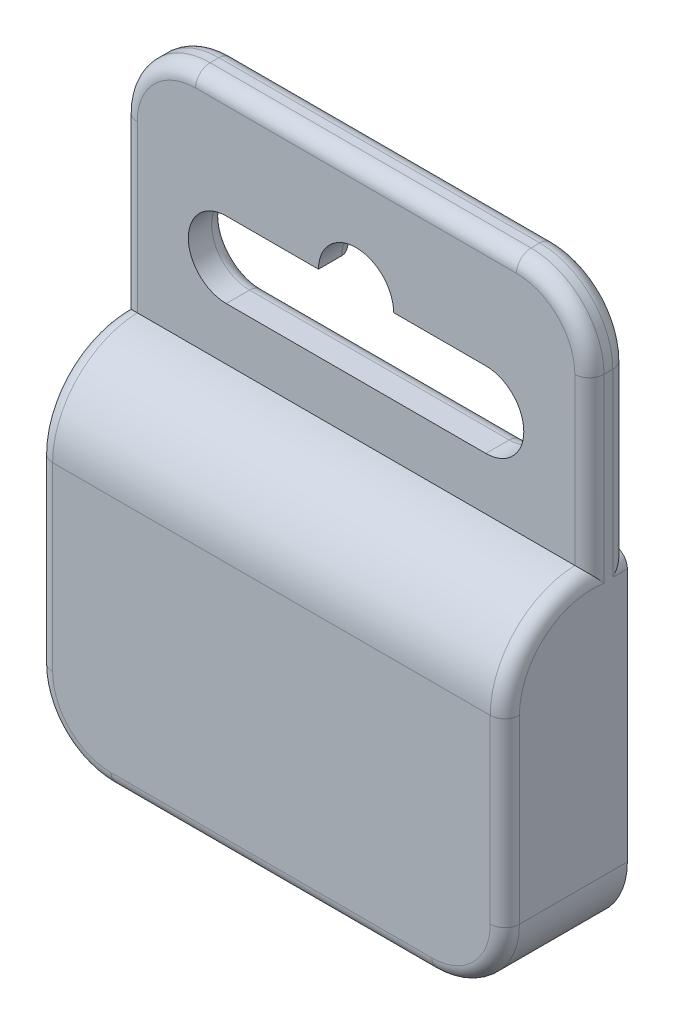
ISO-10303-21;
HEADER;
FILE_DESCRIPTION(('STEP AP214'),'2;1');
FILE_NAME('part.step','',(''),(''),'','','');
FILE_SCHEMA(('AUTOMOTIVE_DESIGN { 1 0 10303 214 1 1 1 1 }'));
ENDSEC;
DATA;
#1=APPLICATION_CONTEXT('core data for automotive mechanical design processes');
#2=APPLICATION_PROTOCOL_DEFINITION('international standard','automotive_design',2000,#1);
#3=PRODUCT_CONTEXT('',#1,'mechanical');
#4=PRODUCT('Part','Part','',(#3));
#5=PRODUCT_RELATED_PRODUCT_CATEGORY('part','',(#4));
#6=PRODUCT_DEFINITION_FORMATION('','',#4);
#7=PRODUCT_DEFINITION_CONTEXT('part definition',#1,'design');
#8=PRODUCT_DEFINITION('design','',#6,#7);
#9=PRODUCT_DEFINITION_SHAPE('','',#8);
#10=(LENGTH_UNIT() NAMED_UNIT(*) SI_UNIT(.MILLI.,.METRE.));
#11=(NAMED_UNIT(*) PLANE_ANGLE_UNIT() SI_UNIT($,.RADIAN.));
#12=(NAMED_UNIT(*) SI_UNIT($,.STERADIAN.) SOLID_ANGLE_UNIT());
#13=UNCERTAINTY_MEASURE_WITH_UNIT(LENGTH_MEASURE(1.E-05),#10,'distance_accuracy_value','');
#14=(GEOMETRIC_REPRESENTATION_CONTEXT(3) GLOBAL_UNCERTAINTY_ASSIGNED_CONTEXT((#13)) GLOBAL_UNIT_ASSIGNED_CONTEXT((#10,
#11,#12)) REPRESENTATION_CONTEXT('',''));
#15=CARTESIAN_POINT('',(0.,0.,0.));
#16=DIRECTION('',(0.,0.,1.));
#17=DIRECTION('',(1.,0.,0.));
#18=AXIS2_PLACEMENT_3D('',#15,#16,#17);
#19=CARTESIAN_POINT('',(0.,23.9695789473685,4.572));
#20=DIRECTION('',(1.,0.,0.));
#21=DIRECTION('',(0.,0.,-1.));
#22=AXIS2_PLACEMENT_3D('',#19,#20,#21);
#23=CYLINDRICAL_SURFACE('',#22,1.27);
#24=CARTESIAN_POINT('',(-13.97,23.9695789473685,4.572));
#25=DIRECTION('',(1.,0.,0.));
#26=DIRECTION('',(0.,0.,-1.));
#27=AXIS2_PLACEMENT_3D('',#24,#25,#26);
#28=CIRCLE('',#27,1.27);
#29=CARTESIAN_POINT('',(-13.97,25.2395789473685,4.572));
#30=VERTEX_POINT('',#29);
#31=CARTESIAN_POINT('',(-13.97,23.9695789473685,5.842));
#32=VERTEX_POINT('',#31);
#33=EDGE_CURVE('E433',#30,#32,#28,.T.);
#34=ORIENTED_EDGE('',*,*,#33,.T.);
#35=DIRECTION('',(-1.,0.,0.));
#36=VECTOR('',#35,1.);
#37=CARTESIAN_POINT('',(-13.97,23.9695789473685,5.842));
#38=LINE('',#37,#36);
#39=CARTESIAN_POINT('',(13.97,23.9695789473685,5.842));
#40=VERTEX_POINT('',#39);
#41=EDGE_CURVE('E397',#40,#32,#38,.T.);
#42=ORIENTED_EDGE('',*,*,#41,.F.);
#43=CARTESIAN_POINT('',(13.97,23.9695789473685,4.572));
#44=DIRECTION('',(1.,0.,0.));
#45=DIRECTION('',(0.,0.,-1.));
#46=AXIS2_PLACEMENT_3D('',#43,#44,#45);
#47=CIRCLE('',#46,1.27);
#48=CARTESIAN_POINT('',(13.97,25.2395789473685,4.572));
#49=VERTEX_POINT('',#48);
#50=EDGE_CURVE('E427',#49,#40,#47,.T.);
#51=ORIENTED_EDGE('',*,*,#50,.F.);
#52=DIRECTION('',(-1.,0.,0.));
#53=VECTOR('',#52,1.);
#54=CARTESIAN_POINT('',(13.97,25.2395789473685,4.572));
#55=LINE('',#54,#53);
#56=EDGE_CURVE('E384',#30,#49,#55,.F.);
#57=ORIENTED_EDGE('',*,*,#56,.F.);
#58=EDGE_LOOP('',(#34,#42,#51,#57));
#59=FACE_BOUND('',#58,.T.);
#60=ADVANCED_FACE('F42',(#59),#23,.T.);
#61=CARTESIAN_POINT('',(13.97,18.8895789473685,4.572));
#62=DIRECTION('',(0.,0.,1.));
#63=DIRECTION('',(1.,0.,0.));
#64=AXIS2_PLACEMENT_3D('',#61,#62,#63);
#65=TOROIDAL_SURFACE('',#64,5.08,1.27);
#66=CARTESIAN_POINT('',(19.05,18.8895789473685,4.572));
#67=DIRECTION('',(0.,1.,0.));
#68=DIRECTION('',(0.,0.,1.));
#69=AXIS2_PLACEMENT_3D('',#66,#67,#68);
#70=CIRCLE('',#69,1.27);
#71=CARTESIAN_POINT('',(19.05,18.8895789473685,5.842));
#72=VERTEX_POINT('',#71);
#73=CARTESIAN_POINT('',(20.32,18.8895789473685,4.572));
#74=VERTEX_POINT('',#73);
#75=EDGE_CURVE('E429',#72,#74,#70,.T.);
#76=ORIENTED_EDGE('',*,*,#75,.T.);
#77=CARTESIAN_POINT('',(13.97,18.8895789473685,4.572));
#78=DIRECTION('',(0.,0.,1.));
#79=DIRECTION('',(1.,0.,0.));
#80=AXIS2_PLACEMENT_3D('',#77,#78,#79);
#81=CIRCLE('',#80,6.35);
#82=EDGE_CURVE('E378',#49,#74,#81,.F.);
#83=ORIENTED_EDGE('',*,*,#82,.F.);
#84=ORIENTED_EDGE('',*,*,#50,.T.);
#85=CARTESIAN_POINT('',(13.97,18.8895789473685,5.842));
#86=DIRECTION('',(0.,0.,1.));
#87=DIRECTION('',(1.,0.,0.));
#88=AXIS2_PLACEMENT_3D('',#85,#86,#87);
#89=CIRCLE('',#88,5.08);
#90=EDGE_CURVE('E399',#72,#40,#89,.T.);
#91=ORIENTED_EDGE('',*,*,#90,.F.);
#92=EDGE_LOOP('',(#76,#83,#84,#91));
#93=FACE_BOUND('',#92,.T.);
#94=ADVANCED_FACE('F766',(#93),#65,.T.);
#95=CARTESIAN_POINT('',(-13.97,18.8895789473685,4.572));
#96=DIRECTION('',(0.,0.,1.));
#97=DIRECTION('',(1.,0.,0.));
#98=AXIS2_PLACEMENT_3D('',#95,#96,#97);
#99=TOROIDAL_SURFACE('',#98,5.08,1.27);
#100=CARTESIAN_POINT('',(-19.05,18.8895789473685,4.572));
#101=DIRECTION('',(0.,1.,0.));
#102=DIRECTION('',(0.,0.,1.));
#103=AXIS2_PLACEMENT_3D('',#100,#101,#102);
#104=CIRCLE('',#103,1.27);
#105=CARTESIAN_POINT('',(-20.32,18.8895789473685,4.572));
#106=VERTEX_POINT('',#105);
#107=CARTESIAN_POINT('',(-19.05,18.8895789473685,5.842));
#108=VERTEX_POINT('',#107);
#109=EDGE_CURVE('E420',#106,#108,#104,.T.);
#110=ORIENTED_EDGE('',*,*,#109,.T.);
#111=CARTESIAN_POINT('',(-13.97,18.8895789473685,5.842));
#112=DIRECTION('',(0.,0.,1.));
#113=DIRECTION('',(1.,0.,0.));
#114=AXIS2_PLACEMENT_3D('',#111,#112,#113);
#115=CIRCLE('',#114,5.08);
#116=EDGE_CURVE('E395',#32,#108,#115,.T.);
#117=ORIENTED_EDGE('',*,*,#116,.F.);
#118=ORIENTED_EDGE('',*,*,#33,.F.);
#119=CARTESIAN_POINT('',(-13.97,18.8895789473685,4.572));
#120=DIRECTION('',(0.,0.,1.));
#121=DIRECTION('',(1.,0.,0.));
#122=AXIS2_PLACEMENT_3D('',#119,#120,#121);
#123=CIRCLE('',#122,6.35);
#124=EDGE_CURVE('E388',#106,#30,#123,.F.);
#125=ORIENTED_EDGE('',*,*,#124,.F.);
#126=EDGE_LOOP('',(#110,#117,#118,#125));
#127=FACE_BOUND('',#126,.T.);
#128=ADVANCED_FACE('F814',(#127),#99,.T.);
#129=CARTESIAN_POINT('',(0.,0.,5.842));
#130=DIRECTION('',(0.,0.,1.));
#131=DIRECTION('',(1.,0.,0.));
#132=AXIS2_PLACEMENT_3D('',#129,#130,#131);
#133=PLANE('',#132);
#134=DIRECTION('',(1.,0.,0.));
#135=VECTOR('',#134,1.);
#136=CARTESIAN_POINT('',(0.,4.47842105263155,5.842));
#137=LINE('',#136,#135);
#138=CARTESIAN_POINT('',(-19.05,4.47842105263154,5.842));
#139=VERTEX_POINT('',#138);
#140=CARTESIAN_POINT('',(19.05,4.47842105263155,5.842));
#141=VERTEX_POINT('',#140);
#142=EDGE_CURVE('E416',#139,#141,#137,.T.);
#143=ORIENTED_EDGE('',*,*,#142,.T.);
#144=DIRECTION('',(0.,1.,0.));
#145=VECTOR('',#144,1.);
#146=CARTESIAN_POINT('',(19.05,18.8895789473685,5.842));
#147=LINE('',#146,#145);
#148=EDGE_CURVE('E402',#141,#72,#147,.T.);
#149=ORIENTED_EDGE('',*,*,#148,.T.);
#150=ORIENTED_EDGE('',*,*,#90,.T.);
#151=ORIENTED_EDGE('',*,*,#41,.T.);
#152=ORIENTED_EDGE('',*,*,#116,.T.);
#153=DIRECTION('',(0.,-1.,0.));
#154=VECTOR('',#153,1.);
#155=CARTESIAN_POINT('',(-19.05,4.47842105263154,5.842));
#156=LINE('',#155,#154);
#157=EDGE_CURVE('E393',#108,#139,#156,.T.);
#158=ORIENTED_EDGE('',*,*,#157,.T.);
#159=EDGE_LOOP('',(#143,#149,#150,#151,#152,#158));
#160=FACE_BOUND('',#159,.T.);
#161=CARTESIAN_POINT('',(0.,15.6544210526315,5.842));
#162=DIRECTION('',(0.,0.,1.));
#163=DIRECTION('',(1.,0.,0.));
#164=AXIS2_PLACEMENT_3D('',#161,#162,#163);
#165=CIRCLE('',#164,3.26971122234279);
#166=CARTESIAN_POINT('',(3.26971122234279,15.6544210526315,5.842));
#167=VERTEX_POINT('',#166);
#168=CARTESIAN_POINT('',(-3.26971122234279,15.6544210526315,5.842));
#169=VERTEX_POINT('',#168);
#170=EDGE_CURVE('E295',#167,#169,#165,.T.);
#171=ORIENTED_EDGE('',*,*,#170,.F.);
#172=DIRECTION('',(-1.,0.,0.));
#173=VECTOR('',#172,1.);
#174=CARTESIAN_POINT('',(0.,15.6544210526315,5.842));
#175=LINE('',#174,#173);
#176=CARTESIAN_POINT('',(11.303,15.6544210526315,5.842));
#177=VERTEX_POINT('',#176);
#178=EDGE_CURVE('E309',#177,#167,#175,.T.);
#179=ORIENTED_EDGE('',*,*,#178,.F.);
#180=CARTESIAN_POINT('',(11.303,12.3524210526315,5.842));
#181=DIRECTION('',(0.,0.,1.));
#182=DIRECTION('',(1.,0.,0.));
#183=AXIS2_PLACEMENT_3D('',#180,#181,#182);
#184=CIRCLE('',#183,3.302);
#185=CARTESIAN_POINT('',(11.303,9.05042105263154,5.842));
#186=VERTEX_POINT('',#185);
#187=EDGE_CURVE('E318',#186,#177,#184,.T.);
#188=ORIENTED_EDGE('',*,*,#187,.F.);
#189=DIRECTION('',(1.,0.,0.));
#190=VECTOR('',#189,1.);
#191=CARTESIAN_POINT('',(0.,9.05042105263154,5.842));
#192=LINE('',#191,#190);
#193=CARTESIAN_POINT('',(-11.303,9.05042105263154,5.842));
#194=VERTEX_POINT('',#193);
#195=EDGE_CURVE('E320',#194,#186,#192,.T.);
#196=ORIENTED_EDGE('',*,*,#195,.F.);
#197=CARTESIAN_POINT('',(-11.303,12.3524210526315,5.842));
#198=DIRECTION('',(0.,0.,1.));
#199=DIRECTION('',(1.,0.,0.));
#200=AXIS2_PLACEMENT_3D('',#197,#198,#199);
#201=CIRCLE('',#200,3.302);
#202=CARTESIAN_POINT('',(-11.303,15.6544210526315,5.842));
#203=VERTEX_POINT('',#202);
#204=EDGE_CURVE('E323',#203,#194,#201,.T.);
#205=ORIENTED_EDGE('',*,*,#204,.F.);
#206=EDGE_CURVE('E313',#169,#203,#175,.T.);
#207=ORIENTED_EDGE('',*,*,#206,.F.);
#208=EDGE_LOOP('',(#171,#179,#188,#196,#205,#207));
#209=FACE_BOUND('',#208,.T.);
#210=ADVANCED_FACE('F307',(#160,#209),#133,.T.);
#211=CARTESIAN_POINT('',(-20.32,-3.14157894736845,5.58362068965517));
#212=DIRECTION('',(1.,0.,0.));
#213=DIRECTION('',(0.,0.,-1.));
#214=AXIS2_PLACEMENT_3D('',#211,#212,#213);
#215=CYLINDRICAL_SURFACE('',#214,7.62437931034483);
#216=DIRECTION('',(1.,0.,0.));
#217=VECTOR('',#216,1.);
#218=CARTESIAN_POINT('',(-20.32,-3.14157894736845,13.208));
#219=LINE('',#218,#217);
#220=CARTESIAN_POINT('',(-19.05,-3.14157894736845,13.208));
#221=VERTEX_POINT('',#220);
#222=CARTESIAN_POINT('',(19.05,-3.14157894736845,13.208));
#223=VERTEX_POINT('',#222);
#224=EDGE_CURVE('E659',#221,#223,#219,.T.);
#225=ORIENTED_EDGE('',*,*,#224,.T.);
#226=CARTESIAN_POINT('',(19.05,-3.14157894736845,5.58362068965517));
#227=DIRECTION('',(-1.,0.,0.));
#228=DIRECTION('',(0.,-1.,0.));
#229=AXIS2_PLACEMENT_3D('',#226,#227,#228);
#230=CIRCLE('',#229,7.62437931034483);
#231=EDGE_CURVE('E734',#223,#141,#230,.T.);
#232=ORIENTED_EDGE('',*,*,#231,.T.);
#233=ORIENTED_EDGE('',*,*,#142,.F.);
#234=CARTESIAN_POINT('',(-19.05,-3.14157894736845,5.58362068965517));
#235=DIRECTION('',(1.,0.,0.));
#236=DIRECTION('',(0.,1.,0.));
#237=AXIS2_PLACEMENT_3D('',#234,#235,#236);
#238=CIRCLE('',#237,7.62437931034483);
#239=EDGE_CURVE('E737',#139,#221,#238,.T.);
#240=ORIENTED_EDGE('',*,*,#239,.T.);
#241=EDGE_LOOP('',(#225,#232,#233,#240));
#242=FACE_BOUND('',#241,.T.);
#243=ADVANCED_FACE('F546',(#242),#215,.T.);
#244=CARTESIAN_POINT('',(0.,0.,13.208));
#245=DIRECTION('',(0.,0.,1.));
#246=DIRECTION('',(1.,0.,0.));
#247=AXIS2_PLACEMENT_3D('',#244,#245,#246);
#248=PLANE('',#247);
#249=CARTESIAN_POINT('',(13.97,-18.8895789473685,13.208));
#250=DIRECTION('',(0.,0.,1.));
#251=DIRECTION('',(1.,0.,0.));
#252=AXIS2_PLACEMENT_3D('',#249,#250,#251);
#253=CIRCLE('',#252,5.08);
#254=CARTESIAN_POINT('',(13.97,-23.9695789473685,13.208));
#255=VERTEX_POINT('',#254);
#256=CARTESIAN_POINT('',(19.05,-18.8895789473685,13.208));
#257=VERTEX_POINT('',#256);
#258=EDGE_CURVE('E648',#255,#257,#253,.T.);
#259=ORIENTED_EDGE('',*,*,#258,.T.);
#260=DIRECTION('',(0.,1.,0.));
#261=VECTOR('',#260,1.);
#262=CARTESIAN_POINT('',(19.05,-3.14157894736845,13.208));
#263=LINE('',#262,#261);
#264=EDGE_CURVE('E645',#257,#223,#263,.T.);
#265=ORIENTED_EDGE('',*,*,#264,.T.);
#266=ORIENTED_EDGE('',*,*,#224,.F.);
#267=DIRECTION('',(0.,-1.,0.));
#268=VECTOR('',#267,1.);
#269=CARTESIAN_POINT('',(-19.05,-18.8895789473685,13.208));
#270=LINE('',#269,#268);
#271=CARTESIAN_POINT('',(-19.05,-18.8895789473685,13.208));
#272=VERTEX_POINT('',#271);
#273=EDGE_CURVE('E652',#221,#272,#270,.T.);
#274=ORIENTED_EDGE('',*,*,#273,.T.);
#275=CARTESIAN_POINT('',(-13.97,-18.8895789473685,13.208));
#276=DIRECTION('',(0.,0.,1.));
#277=DIRECTION('',(1.,0.,0.));
#278=AXIS2_PLACEMENT_3D('',#275,#276,#277);
#279=CIRCLE('',#278,5.08);
#280=CARTESIAN_POINT('',(-13.97,-23.9695789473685,13.208));
#281=VERTEX_POINT('',#280);
#282=EDGE_CURVE('E657',#272,#281,#279,.T.);
#283=ORIENTED_EDGE('',*,*,#282,.T.);
#284=DIRECTION('',(1.,0.,0.));
#285=VECTOR('',#284,1.);
#286=CARTESIAN_POINT('',(13.97,-23.9695789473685,13.208));
#287=LINE('',#286,#285);
#288=EDGE_CURVE('E650',#281,#255,#287,.T.);
#289=ORIENTED_EDGE('',*,*,#288,.T.);
#290=EDGE_LOOP('',(#259,#265,#266,#274,#283,#289));
#291=FACE_BOUND('',#290,.T.);
#292=ADVANCED_FACE('F549',(#291),#248,.T.);
#293=CARTESIAN_POINT('',(0.,25.2395789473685,5.842));
#294=DIRECTION('',(0.,-1.,0.));
#295=DIRECTION('',(0.,0.,-1.));
#296=AXIS2_PLACEMENT_3D('',#293,#294,#295);
#297=PLANE('',#296);
#298=DIRECTION('',(0.,0.,-1.));
#299=VECTOR('',#298,1.);
#300=CARTESIAN_POINT('',(13.97,25.2395789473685,5.842));
#301=LINE('',#300,#299);
#302=CARTESIAN_POINT('',(13.97,25.2395789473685,3.81));
#303=VERTEX_POINT('',#302);
#304=EDGE_CURVE('E344',#49,#303,#301,.T.);
#305=ORIENTED_EDGE('',*,*,#304,.T.);
#306=DIRECTION('',(-1.,0.,0.));
#307=VECTOR('',#306,1.);
#308=CARTESIAN_POINT('',(0.,25.2395789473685,3.81));
#309=LINE('',#308,#307);
#310=CARTESIAN_POINT('',(-13.97,25.2395789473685,3.81));
#311=VERTEX_POINT('',#310);
#312=EDGE_CURVE('E386',#303,#311,#309,.T.);
#313=ORIENTED_EDGE('',*,*,#312,.T.);
#314=DIRECTION('',(0.,0.,-1.));
#315=VECTOR('',#314,1.);
#316=CARTESIAN_POINT('',(-13.97,25.2395789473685,5.842));
#317=LINE('',#316,#315);
#318=EDGE_CURVE('E347',#311,#30,#317,.F.);
#319=ORIENTED_EDGE('',*,*,#318,.T.);
#320=ORIENTED_EDGE('',*,*,#56,.T.);
#321=EDGE_LOOP('',(#305,#313,#319,#320));
#322=FACE_BOUND('',#321,.T.);
#323=ADVANCED_FACE('F552',(#322),#297,.F.);
#324=CARTESIAN_POINT('',(0.,15.6544210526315,5.842));
#325=DIRECTION('',(0.,-1.,0.));
#326=DIRECTION('',(0.,0.,-1.));
#327=AXIS2_PLACEMENT_3D('',#324,#325,#326);
#328=PLANE('',#327);
#329=DIRECTION('',(0.,0.,-1.));
#330=VECTOR('',#329,1.);
#331=CARTESIAN_POINT('',(3.26971122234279,15.6544210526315,5.842));
#332=LINE('',#331,#330);
#333=CARTESIAN_POINT('',(3.26971122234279,15.6544210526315,3.81));
#334=VERTEX_POINT('',#333);
#335=EDGE_CURVE('E291',#167,#334,#332,.T.);
#336=ORIENTED_EDGE('',*,*,#335,.T.);
#337=DIRECTION('',(-1.,0.,0.));
#338=VECTOR('',#337,1.);
#339=CARTESIAN_POINT('',(11.303,15.6544210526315,3.81));
#340=LINE('',#339,#338);
#341=CARTESIAN_POINT('',(11.303,15.6544210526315,3.81));
#342=VERTEX_POINT('',#341);
#343=EDGE_CURVE('E414',#334,#342,#340,.F.);
#344=ORIENTED_EDGE('',*,*,#343,.T.);
#345=DIRECTION('',(0.,0.,-1.));
#346=VECTOR('',#345,1.);
#347=CARTESIAN_POINT('',(11.303,15.6544210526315,5.842));
#348=LINE('',#347,#346);
#349=EDGE_CURVE('E303',#177,#342,#348,.T.);
#350=ORIENTED_EDGE('',*,*,#349,.F.);
#351=ORIENTED_EDGE('',*,*,#178,.T.);
#352=EDGE_LOOP('',(#336,#344,#350,#351));
#353=FACE_BOUND('',#352,.T.);
#354=ADVANCED_FACE('F316',(#353),#328,.T.);
#355=CARTESIAN_POINT('',(11.303,12.3524210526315,5.842));
#356=DIRECTION('',(0.,0.,-1.));
#357=DIRECTION('',(-1.,0.,0.));
#358=AXIS2_PLACEMENT_3D('',#355,#356,#357);
#359=CYLINDRICAL_SURFACE('',#358,3.302);
#360=ORIENTED_EDGE('',*,*,#349,.T.);
#361=CARTESIAN_POINT('',(11.303,12.3524210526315,3.81));
#362=DIRECTION('',(0.,0.,1.));
#363=DIRECTION('',(1.,0.,0.));
#364=AXIS2_PLACEMENT_3D('',#361,#362,#363);
#365=CIRCLE('',#364,3.302);
#366=CARTESIAN_POINT('',(11.303,9.05042105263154,3.81));
#367=VERTEX_POINT('',#366);
#368=EDGE_CURVE('E411',#342,#367,#365,.F.);
#369=ORIENTED_EDGE('',*,*,#368,.T.);
#370=DIRECTION('',(0.,0.,-1.));
#371=VECTOR('',#370,1.);
#372=CARTESIAN_POINT('',(11.303,9.05042105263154,5.842));
#373=LINE('',#372,#371);
#374=EDGE_CURVE('E338',#186,#367,#373,.T.);
#375=ORIENTED_EDGE('',*,*,#374,.F.);
#376=ORIENTED_EDGE('',*,*,#187,.T.);
#377=EDGE_LOOP('',(#360,#369,#375,#376));
#378=FACE_BOUND('',#377,.T.);
#379=ADVANCED_FACE('F794',(#378),#359,.F.);
#380=CARTESIAN_POINT('',(0.,9.05042105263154,5.842));
#381=DIRECTION('',(0.,1.,0.));
#382=DIRECTION('',(0.,0.,1.));
#383=AXIS2_PLACEMENT_3D('',#380,#381,#382);
#384=PLANE('',#383);
#385=ORIENTED_EDGE('',*,*,#374,.T.);
#386=DIRECTION('',(1.,0.,0.));
#387=VECTOR('',#386,1.);
#388=CARTESIAN_POINT('',(-11.303,9.05042105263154,3.81));
#389=LINE('',#388,#387);
#390=CARTESIAN_POINT('',(-11.303,9.05042105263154,3.81));
#391=VERTEX_POINT('',#390);
#392=EDGE_CURVE('E409',#367,#391,#389,.F.);
#393=ORIENTED_EDGE('',*,*,#392,.T.);
#394=DIRECTION('',(0.,0.,-1.));
#395=VECTOR('',#394,1.);
#396=CARTESIAN_POINT('',(-11.303,9.05042105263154,5.842));
#397=LINE('',#396,#395);
#398=EDGE_CURVE('E336',#194,#391,#397,.T.);
#399=ORIENTED_EDGE('',*,*,#398,.F.);
#400=ORIENTED_EDGE('',*,*,#195,.T.);
#401=EDGE_LOOP('',(#385,#393,#399,#400));
#402=FACE_BOUND('',#401,.T.);
#403=ADVANCED_FACE('F1058',(#402),#384,.T.);
#404=CARTESIAN_POINT('',(-11.303,12.3524210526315,5.842));
#405=DIRECTION('',(0.,0.,-1.));
#406=DIRECTION('',(-1.,0.,0.));
#407=AXIS2_PLACEMENT_3D('',#404,#405,#406);
#408=CYLINDRICAL_SURFACE('',#407,3.302);
#409=ORIENTED_EDGE('',*,*,#398,.T.);
#410=CARTESIAN_POINT('',(-11.303,12.3524210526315,3.81));
#411=DIRECTION('',(0.,0.,1.));
#412=DIRECTION('',(1.,0.,0.));
#413=AXIS2_PLACEMENT_3D('',#410,#411,#412);
#414=CIRCLE('',#413,3.302);
#415=CARTESIAN_POINT('',(-11.303,15.6544210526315,3.81));
#416=VERTEX_POINT('',#415);
#417=EDGE_CURVE('E407',#391,#416,#414,.F.);
#418=ORIENTED_EDGE('',*,*,#417,.T.);
#419=DIRECTION('',(0.,0.,-1.));
#420=VECTOR('',#419,1.);
#421=CARTESIAN_POINT('',(-11.303,15.6544210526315,5.842));
#422=LINE('',#421,#420);
#423=EDGE_CURVE('E326',#203,#416,#422,.T.);
#424=ORIENTED_EDGE('',*,*,#423,.F.);
#425=ORIENTED_EDGE('',*,*,#204,.T.);
#426=EDGE_LOOP('',(#409,#418,#424,#425));
#427=FACE_BOUND('',#426,.T.);
#428=ADVANCED_FACE('F790',(#427),#408,.F.);
#429=ORIENTED_EDGE('',*,*,#423,.T.);
#430=DIRECTION('',(-1.,0.,0.));
#431=VECTOR('',#430,1.);
#432=CARTESIAN_POINT('',(-3.26971122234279,15.6544210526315,3.81));
#433=LINE('',#432,#431);
#434=CARTESIAN_POINT('',(-3.26971122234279,15.6544210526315,3.81));
#435=VERTEX_POINT('',#434);
#436=EDGE_CURVE('E404',#416,#435,#433,.F.);
#437=ORIENTED_EDGE('',*,*,#436,.T.);
#438=DIRECTION('',(0.,0.,-1.));
#439=VECTOR('',#438,1.);
#440=CARTESIAN_POINT('',(-3.26971122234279,15.6544210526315,5.842));
#441=LINE('',#440,#439);
#442=EDGE_CURVE('E322',#169,#435,#441,.T.);
#443=ORIENTED_EDGE('',*,*,#442,.F.);
#444=ORIENTED_EDGE('',*,*,#206,.T.);
#445=EDGE_LOOP('',(#429,#437,#443,#444));
#446=FACE_BOUND('',#445,.T.);
#447=ADVANCED_FACE('F785',(#446),#328,.T.);
#448=CARTESIAN_POINT('',(0.,15.6544210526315,5.842));
#449=DIRECTION('',(0.,0.,-1.));
#450=DIRECTION('',(-1.,0.,0.));
#451=AXIS2_PLACEMENT_3D('',#448,#449,#450);
#452=CYLINDRICAL_SURFACE('',#451,3.26971122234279);
#453=ORIENTED_EDGE('',*,*,#442,.T.);
#454=CARTESIAN_POINT('',(0.,15.6544210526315,3.81));
#455=DIRECTION('',(0.,0.,1.));
#456=DIRECTION('',(1.,0.,0.));
#457=AXIS2_PLACEMENT_3D('',#454,#455,#456);
#458=CIRCLE('',#457,3.26971122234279);
#459=EDGE_CURVE('E298',#435,#334,#458,.F.);
#460=ORIENTED_EDGE('',*,*,#459,.T.);
#461=ORIENTED_EDGE('',*,*,#335,.F.);
#462=ORIENTED_EDGE('',*,*,#170,.T.);
#463=EDGE_LOOP('',(#453,#460,#461,#462));
#464=FACE_BOUND('',#463,.T.);
#465=ADVANCED_FACE('F294',(#464),#452,.F.);
#466=CARTESIAN_POINT('',(19.05,0.,11.938));
#467=DIRECTION('',(0.,-1.,0.));
#468=DIRECTION('',(1.,0.,0.));
#469=AXIS2_PLACEMENT_3D('',#466,#467,#468);
#470=CYLINDRICAL_SURFACE('',#469,1.27);
#471=CARTESIAN_POINT('',(19.05,-18.8895789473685,11.938));
#472=DIRECTION('',(0.,1.,0.));
#473=DIRECTION('',(0.,0.,1.));
#474=AXIS2_PLACEMENT_3D('',#471,#472,#473);
#475=CIRCLE('',#474,1.27);
#476=CARTESIAN_POINT('',(20.32,-18.8895789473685,11.938));
#477=VERTEX_POINT('',#476);
#478=EDGE_CURVE('E496',#257,#477,#475,.T.);
#479=ORIENTED_EDGE('',*,*,#478,.T.);
#480=DIRECTION('',(0.,1.,0.));
#481=VECTOR('',#480,1.);
#482=CARTESIAN_POINT('',(20.32,-18.8895789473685,11.938));
#483=LINE('',#482,#481);
#484=CARTESIAN_POINT('',(20.32,-3.14157894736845,11.938));
#485=VERTEX_POINT('',#484);
#486=EDGE_CURVE('E739',#485,#477,#483,.F.);
#487=ORIENTED_EDGE('',*,*,#486,.F.);
#488=CARTESIAN_POINT('',(19.05,-3.14157894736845,11.938));
#489=DIRECTION('',(0.,1.,0.));
#490=DIRECTION('',(0.,0.,1.));
#491=AXIS2_PLACEMENT_3D('',#488,#489,#490);
#492=CIRCLE('',#491,1.27);
#493=EDGE_CURVE('E508',#223,#485,#492,.T.);
#494=ORIENTED_EDGE('',*,*,#493,.F.);
#495=ORIENTED_EDGE('',*,*,#264,.F.);
#496=EDGE_LOOP('',(#479,#487,#494,#495));
#497=FACE_BOUND('',#496,.T.);
#498=ADVANCED_FACE('F521',(#497),#470,.T.);
#499=CARTESIAN_POINT('',(19.05,-3.14157894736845,5.58362068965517));
#500=DIRECTION('',(-1.,0.,0.));
#501=DIRECTION('',(0.,-1.,0.));
#502=AXIS2_PLACEMENT_3D('',#499,#500,#501);
#503=TOROIDAL_SURFACE('',#502,6.35437931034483,1.27);
#504=ORIENTED_EDGE('',*,*,#493,.T.);
#505=CARTESIAN_POINT('',(20.32,-3.14157894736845,5.58362068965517));
#506=DIRECTION('',(-1.,0.,0.));
#507=DIRECTION('',(0.,-1.,0.));
#508=AXIS2_PLACEMENT_3D('',#505,#506,#507);
#509=CIRCLE('',#508,6.35437931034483);
#510=CARTESIAN_POINT('',(20.32,3.13175828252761,4.572));
#511=VERTEX_POINT('',#510);
#512=EDGE_CURVE('E671',#511,#485,#509,.F.);
#513=ORIENTED_EDGE('',*,*,#512,.F.);
#514=CARTESIAN_POINT('',(19.05,4.47842105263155,5.842));
#515=CARTESIAN_POINT('',(19.0785618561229,4.47842394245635,5.84200357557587));
#516=CARTESIAN_POINT('',(19.107106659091,4.47748887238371,5.84103562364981));
#517=CARTESIAN_POINT('',(19.1639290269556,4.47377933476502,5.83719932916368));
#518=CARTESIAN_POINT('',(19.1922067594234,4.47100611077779,5.83433227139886));
#519=CARTESIAN_POINT('',(19.275863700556,4.46004546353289,5.82300991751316));
#520=CARTESIAN_POINT('',(19.3305669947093,4.44921560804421,5.8118317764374));
#521=CARTESIAN_POINT('',(19.4363329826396,4.42123855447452,5.78305467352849));
#522=CARTESIAN_POINT('',(19.4874037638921,4.4041059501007,5.76547054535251));
#523=CARTESIAN_POINT('',(19.585203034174,4.36443506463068,5.72493863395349));
#524=CARTESIAN_POINT('',(19.6319226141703,4.34188601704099,5.70198017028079));
#525=CARTESIAN_POINT('',(19.7369274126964,4.28311372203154,5.64246931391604));
#526=CARTESIAN_POINT('',(19.7930450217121,4.24492474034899,5.60403778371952));
#527=CARTESIAN_POINT('',(19.8958148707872,4.16231457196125,5.52165954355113));
#528=CARTESIAN_POINT('',(19.9424502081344,4.11788249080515,5.47770320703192));
#529=CARTESIAN_POINT('',(20.0432490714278,4.00600892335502,5.36816022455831));
#530=CARTESIAN_POINT('',(20.0931422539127,3.93639794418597,5.3008734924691));
#531=CARTESIAN_POINT('',(20.1770687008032,3.79132027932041,5.16289332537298));
#532=CARTESIAN_POINT('',(20.2110766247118,3.7158444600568,5.09219464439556));
#533=CARTESIAN_POINT('',(20.2659807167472,3.55800062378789,4.94690718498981));
#534=CARTESIAN_POINT('',(20.2863048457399,3.47547806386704,4.87227516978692));
#535=CARTESIAN_POINT('',(20.3131645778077,3.30792799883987,4.72366800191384));
#536=CARTESIAN_POINT('',(20.3197241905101,3.22290511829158,4.64969192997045));
#537=CARTESIAN_POINT('',(20.3199971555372,3.13539867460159,4.57510105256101));
#538=CARTESIAN_POINT('',(20.319999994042,3.1335786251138,4.57355031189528));
#539=CARTESIAN_POINT('',(20.32,3.13175828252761,4.572));
#540=B_SPLINE_CURVE_WITH_KNOTS('',3,(#514,#515,#516,#517,#518,#519,#520,#521,#522,#523,#524,
#525,#526,#527,#528,#529,#530,#531,#532,#533,#534,#535,#536,#537,#538,#539),.UNSPECIFIED.,.F.,
.F.,(4,2,2,2,2,2,2,2,2,2,2,2,4),(0.,0.0856214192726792,0.171184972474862,0.340834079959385,
0.510092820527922,0.679690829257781,0.912414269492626,1.14554898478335,1.47051457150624,
1.79599679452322,2.13435748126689,2.47212746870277,2.47930077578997),.UNSPECIFIED.);
#541=EDGE_CURVE('E531',#141,#511,#540,.T.);
#542=ORIENTED_EDGE('',*,*,#541,.F.);
#543=ORIENTED_EDGE('',*,*,#231,.F.);
#544=EDGE_LOOP('',(#504,#513,#542,#543));
#545=FACE_BOUND('',#544,.T.);
#546=ADVANCED_FACE('F523',(#545),#503,.T.);
#547=CARTESIAN_POINT('',(19.05,0.,4.572));
#548=DIRECTION('',(0.,-1.,0.));
#549=DIRECTION('',(1.,0.,0.));
#550=AXIS2_PLACEMENT_3D('',#547,#548,#549);
#551=CYLINDRICAL_SURFACE('',#550,1.27);
#552=DIRECTION('',(0.,1.,0.));
#553=VECTOR('',#552,1.);
#554=CARTESIAN_POINT('',(20.32,4.47842105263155,4.572));
#555=LINE('',#554,#553);
#556=EDGE_CURVE('E668',#74,#511,#555,.F.);
#557=ORIENTED_EDGE('',*,*,#556,.F.);
#558=ORIENTED_EDGE('',*,*,#75,.F.);
#559=ORIENTED_EDGE('',*,*,#148,.F.);
#560=ORIENTED_EDGE('',*,*,#541,.T.);
#561=EDGE_LOOP('',(#557,#558,#559,#560));
#562=FACE_BOUND('',#561,.T.);
#563=ADVANCED_FACE('F527',(#562),#551,.T.);
#564=CARTESIAN_POINT('',(13.97,18.8895789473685,5.842));
#565=DIRECTION('',(0.,0.,-1.));
#566=DIRECTION('',(-1.,0.,0.));
#567=AXIS2_PLACEMENT_3D('',#564,#565,#566);
#568=CYLINDRICAL_SURFACE('',#567,6.35);
#569=DIRECTION('',(0.,0.,-1.));
#570=VECTOR('',#569,1.);
#571=CARTESIAN_POINT('',(20.32,18.8895789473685,13.208));
#572=LINE('',#571,#570);
#573=CARTESIAN_POINT('',(20.32,18.8895789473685,3.81));
#574=VERTEX_POINT('',#573);
#575=EDGE_CURVE('E350',#574,#74,#572,.F.);
#576=ORIENTED_EDGE('',*,*,#575,.F.);
#577=CARTESIAN_POINT('',(13.97,18.8895789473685,3.81));
#578=DIRECTION('',(0.,0.,1.));
#579=DIRECTION('',(1.,0.,0.));
#580=AXIS2_PLACEMENT_3D('',#577,#578,#579);
#581=CIRCLE('',#580,6.35);
#582=EDGE_CURVE('E381',#574,#303,#581,.T.);
#583=ORIENTED_EDGE('',*,*,#582,.T.);
#584=ORIENTED_EDGE('',*,*,#304,.F.);
#585=ORIENTED_EDGE('',*,*,#82,.T.);
#586=EDGE_LOOP('',(#576,#583,#584,#585));
#587=FACE_BOUND('',#586,.T.);
#588=ADVANCED_FACE('F544',(#587),#568,.T.);
#589=CARTESIAN_POINT('',(-13.97,18.8895789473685,13.208));
#590=DIRECTION('',(0.,0.,-1.));
#591=DIRECTION('',(-1.,0.,0.));
#592=AXIS2_PLACEMENT_3D('',#589,#590,#591);
#593=CYLINDRICAL_SURFACE('',#592,6.35);
#594=ORIENTED_EDGE('',*,*,#318,.F.);
#595=CARTESIAN_POINT('',(-13.97,18.8895789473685,3.81));
#596=DIRECTION('',(0.,0.,1.));
#597=DIRECTION('',(1.,0.,0.));
#598=AXIS2_PLACEMENT_3D('',#595,#596,#597);
#599=CIRCLE('',#598,6.35);
#600=CARTESIAN_POINT('',(-20.32,18.8895789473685,3.81));
#601=VERTEX_POINT('',#600);
#602=EDGE_CURVE('E390',#311,#601,#599,.T.);
#603=ORIENTED_EDGE('',*,*,#602,.T.);
#604=DIRECTION('',(0.,0.,-1.));
#605=VECTOR('',#604,1.);
#606=CARTESIAN_POINT('',(-20.32,18.8895789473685,13.208));
#607=LINE('',#606,#605);
#608=EDGE_CURVE('E302',#106,#601,#607,.T.);
#609=ORIENTED_EDGE('',*,*,#608,.F.);
#610=ORIENTED_EDGE('',*,*,#124,.T.);
#611=EDGE_LOOP('',(#594,#603,#609,#610));
#612=FACE_BOUND('',#611,.T.);
#613=ADVANCED_FACE('F796',(#612),#593,.T.);
#614=CARTESIAN_POINT('',(-19.05,0.,4.572));
#615=DIRECTION('',(0.,1.,0.));
#616=DIRECTION('',(-1.,0.,0.));
#617=AXIS2_PLACEMENT_3D('',#614,#615,#616);
#618=CYLINDRICAL_SURFACE('',#617,1.27);
#619=CARTESIAN_POINT('',(-19.05,4.47842105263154,5.842));
#620=CARTESIAN_POINT('',(-19.0785618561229,4.47842394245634,5.84200357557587));
#621=CARTESIAN_POINT('',(-19.107106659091,4.47748887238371,5.84103562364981));
#622=CARTESIAN_POINT('',(-19.1639290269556,4.47377933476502,5.83719932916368));
#623=CARTESIAN_POINT('',(-19.1922067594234,4.47100611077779,5.83433227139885));
#624=CARTESIAN_POINT('',(-19.275863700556,4.46004546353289,5.82300991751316));
#625=CARTESIAN_POINT('',(-19.3305669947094,4.44921560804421,5.8118317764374));
#626=CARTESIAN_POINT('',(-19.4363329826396,4.42123855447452,5.78305467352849));
#627=CARTESIAN_POINT('',(-19.4874037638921,4.4041059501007,5.76547054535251));
#628=CARTESIAN_POINT('',(-19.585203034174,4.36443506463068,5.72493863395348));
#629=CARTESIAN_POINT('',(-19.6319226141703,4.34188601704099,5.70198017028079));
#630=CARTESIAN_POINT('',(-19.7369274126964,4.28311372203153,5.64246931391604));
#631=CARTESIAN_POINT('',(-19.7930450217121,4.24492474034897,5.60403778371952));
#632=CARTESIAN_POINT('',(-19.8958148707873,4.16231457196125,5.52165954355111));
#633=CARTESIAN_POINT('',(-19.9424502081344,4.11788249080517,5.47770320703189));
#634=CARTESIAN_POINT('',(-20.0432490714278,4.00600892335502,5.36816022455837));
#635=CARTESIAN_POINT('',(-20.0931422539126,3.9363979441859,5.30087349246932));
#636=CARTESIAN_POINT('',(-20.1770687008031,3.79132027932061,5.16289332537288));
#637=CARTESIAN_POINT('',(-20.2110766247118,3.71584446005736,5.09219464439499));
#638=CARTESIAN_POINT('',(-20.2659807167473,3.55800062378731,4.94690718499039));
#639=CARTESIAN_POINT('',(-20.2863048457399,3.47547806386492,4.8722751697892));
#640=CARTESIAN_POINT('',(-20.3131645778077,3.30792799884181,4.72366800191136));
#641=CARTESIAN_POINT('',(-20.3197241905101,3.22290511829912,4.64969192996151));
#642=CARTESIAN_POINT('',(-20.3199971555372,3.13539867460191,4.57510105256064));
#643=CARTESIAN_POINT('',(-20.319999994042,3.13357862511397,4.57355031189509));
#644=CARTESIAN_POINT('',(-20.32,3.13175828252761,4.572));
#645=B_SPLINE_CURVE_WITH_KNOTS('',3,(#619,#620,#621,#622,#623,#624,#625,#626,#627,#628,#629,
#630,#631,#632,#633,#634,#635,#636,#637,#638,#639,#640,#641,#642,#643,#644),.UNSPECIFIED.,.F.,
.F.,(4,2,2,2,2,2,2,2,2,2,2,2,4),(0.,0.0856214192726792,0.171184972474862,0.340834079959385,
0.510092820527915,0.679690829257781,0.912414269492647,1.14554898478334,1.4705145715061,
1.79599679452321,2.1343574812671,2.47212746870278,2.47930077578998),.UNSPECIFIED.);
#646=CARTESIAN_POINT('',(-20.32,3.13175828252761,4.572));
#647=VERTEX_POINT('',#646);
#648=EDGE_CURVE('E499',#647,#139,#645,.F.);
#649=ORIENTED_EDGE('',*,*,#648,.T.);
#650=ORIENTED_EDGE('',*,*,#157,.F.);
#651=ORIENTED_EDGE('',*,*,#109,.F.);
#652=DIRECTION('',(0.,-1.,0.));
#653=VECTOR('',#652,1.);
#654=CARTESIAN_POINT('',(-20.32,18.8895789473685,4.572));
#655=LINE('',#654,#653);
#656=EDGE_CURVE('E636',#647,#106,#655,.F.);
#657=ORIENTED_EDGE('',*,*,#656,.F.);
#658=EDGE_LOOP('',(#649,#650,#651,#657));
#659=FACE_BOUND('',#658,.T.);
#660=ADVANCED_FACE('F510',(#659),#618,.T.);
#661=CARTESIAN_POINT('',(-19.05,-3.14157894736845,5.58362068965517));
#662=DIRECTION('',(1.,0.,0.));
#663=DIRECTION('',(0.,1.,0.));
#664=AXIS2_PLACEMENT_3D('',#661,#662,#663);
#665=TOROIDAL_SURFACE('',#664,6.35437931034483,1.27);
#666=CARTESIAN_POINT('',(-19.05,-3.14157894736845,11.938));
#667=DIRECTION('',(0.,1.,0.));
#668=DIRECTION('',(0.,0.,1.));
#669=AXIS2_PLACEMENT_3D('',#666,#667,#668);
#670=CIRCLE('',#669,1.27);
#671=CARTESIAN_POINT('',(-20.32,-3.14157894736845,11.938));
#672=VERTEX_POINT('',#671);
#673=EDGE_CURVE('E493',#672,#221,#670,.T.);
#674=ORIENTED_EDGE('',*,*,#673,.T.);
#675=ORIENTED_EDGE('',*,*,#239,.F.);
#676=ORIENTED_EDGE('',*,*,#648,.F.);
#677=CARTESIAN_POINT('',(-20.32,-3.14157894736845,5.58362068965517));
#678=DIRECTION('',(1.,0.,0.));
#679=DIRECTION('',(0.,1.,0.));
#680=AXIS2_PLACEMENT_3D('',#677,#678,#679);
#681=CIRCLE('',#680,6.35437931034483);
#682=EDGE_CURVE('E663',#672,#647,#681,.F.);
#683=ORIENTED_EDGE('',*,*,#682,.F.);
#684=EDGE_LOOP('',(#674,#675,#676,#683));
#685=FACE_BOUND('',#684,.T.);
#686=ADVANCED_FACE('F514',(#685),#665,.T.);
#687=CARTESIAN_POINT('',(-19.05,0.,11.938));
#688=DIRECTION('',(0.,1.,0.));
#689=DIRECTION('',(-1.,0.,0.));
#690=AXIS2_PLACEMENT_3D('',#687,#688,#689);
#691=CYLINDRICAL_SURFACE('',#690,1.27);
#692=CARTESIAN_POINT('',(-19.05,-18.8895789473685,11.938));
#693=DIRECTION('',(0.,1.,0.));
#694=DIRECTION('',(0.,0.,1.));
#695=AXIS2_PLACEMENT_3D('',#692,#693,#694);
#696=CIRCLE('',#695,1.27);
#697=CARTESIAN_POINT('',(-20.32,-18.8895789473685,11.938));
#698=VERTEX_POINT('',#697);
#699=EDGE_CURVE('E486',#698,#272,#696,.T.);
#700=ORIENTED_EDGE('',*,*,#699,.T.);
#701=ORIENTED_EDGE('',*,*,#273,.F.);
#702=ORIENTED_EDGE('',*,*,#673,.F.);
#703=DIRECTION('',(0.,-1.,0.));
#704=VECTOR('',#703,1.);
#705=CARTESIAN_POINT('',(-20.32,-3.14157894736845,11.938));
#706=LINE('',#705,#704);
#707=EDGE_CURVE('E667',#698,#672,#706,.F.);
#708=ORIENTED_EDGE('',*,*,#707,.F.);
#709=EDGE_LOOP('',(#700,#701,#702,#708));
#710=FACE_BOUND('',#709,.T.);
#711=ADVANCED_FACE('F519',(#710),#691,.T.);
#712=CARTESIAN_POINT('',(0.,-23.9695789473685,11.938));
#713=DIRECTION('',(-1.,0.,0.));
#714=DIRECTION('',(0.,-1.,0.));
#715=AXIS2_PLACEMENT_3D('',#712,#713,#714);
#716=CYLINDRICAL_SURFACE('',#715,1.27);
#717=CARTESIAN_POINT('',(-13.97,-23.9695789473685,11.938));
#718=DIRECTION('',(1.,0.,0.));
#719=DIRECTION('',(0.,0.,-1.));
#720=AXIS2_PLACEMENT_3D('',#717,#718,#719);
#721=CIRCLE('',#720,1.27);
#722=CARTESIAN_POINT('',(-13.97,-25.2395789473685,11.938));
#723=VERTEX_POINT('',#722);
#724=EDGE_CURVE('E483',#281,#723,#721,.T.);
#725=ORIENTED_EDGE('',*,*,#724,.T.);
#726=DIRECTION('',(1.,0.,0.));
#727=VECTOR('',#726,1.);
#728=CARTESIAN_POINT('',(-13.97,-25.2395789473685,11.938));
#729=LINE('',#728,#727);
#730=CARTESIAN_POINT('',(13.97,-25.2395789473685,11.938));
#731=VERTEX_POINT('',#730);
#732=EDGE_CURVE('E595',#731,#723,#729,.F.);
#733=ORIENTED_EDGE('',*,*,#732,.F.);
#734=CARTESIAN_POINT('',(13.97,-23.9695789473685,11.938));
#735=DIRECTION('',(1.,0.,0.));
#736=DIRECTION('',(0.,0.,-1.));
#737=AXIS2_PLACEMENT_3D('',#734,#735,#736);
#738=CIRCLE('',#737,1.27);
#739=EDGE_CURVE('E490',#255,#731,#738,.T.);
#740=ORIENTED_EDGE('',*,*,#739,.F.);
#741=ORIENTED_EDGE('',*,*,#288,.F.);
#742=EDGE_LOOP('',(#725,#733,#740,#741));
#743=FACE_BOUND('',#742,.T.);
#744=ADVANCED_FACE('F641',(#743),#716,.T.);
#745=CARTESIAN_POINT('',(13.97,-18.8895789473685,11.938));
#746=DIRECTION('',(0.,0.,1.));
#747=DIRECTION('',(1.,0.,0.));
#748=AXIS2_PLACEMENT_3D('',#745,#746,#747);
#749=TOROIDAL_SURFACE('',#748,5.08,1.27);
#750=ORIENTED_EDGE('',*,*,#739,.T.);
#751=CARTESIAN_POINT('',(13.97,-18.8895789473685,11.938));
#752=DIRECTION('',(0.,0.,1.));
#753=DIRECTION('',(1.,0.,0.));
#754=AXIS2_PLACEMENT_3D('',#751,#752,#753);
#755=CIRCLE('',#754,6.35);
#756=EDGE_CURVE('E632',#477,#731,#755,.F.);
#757=ORIENTED_EDGE('',*,*,#756,.F.);
#758=ORIENTED_EDGE('',*,*,#478,.F.);
#759=ORIENTED_EDGE('',*,*,#258,.F.);
#760=EDGE_LOOP('',(#750,#757,#758,#759));
#761=FACE_BOUND('',#760,.T.);
#762=ADVANCED_FACE('F562',(#761),#749,.T.);
#763=CARTESIAN_POINT('',(20.32,0.,13.208));
#764=DIRECTION('',(-1.,0.,0.));
#765=DIRECTION('',(0.,-1.,0.));
#766=AXIS2_PLACEMENT_3D('',#763,#764,#765);
#767=PLANE('',#766);
#768=DIRECTION('',(0.,0.,-1.));
#769=VECTOR('',#768,1.);
#770=CARTESIAN_POINT('',(20.32,-18.8895789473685,13.208));
#771=LINE('',#770,#769);
#772=CARTESIAN_POINT('',(20.32,-18.8895789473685,2.54));
#773=VERTEX_POINT('',#772);
#774=EDGE_CURVE('E599',#477,#773,#771,.T.);
#775=ORIENTED_EDGE('',*,*,#774,.T.);
#776=DIRECTION('',(0.,1.,0.));
#777=VECTOR('',#776,1.);
#778=CARTESIAN_POINT('',(20.32,0.,2.54));
#779=LINE('',#778,#777);
#780=CARTESIAN_POINT('',(20.32,3.20842105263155,2.54));
#781=VERTEX_POINT('',#780);
#782=EDGE_CURVE('E623',#773,#781,#779,.T.);
#783=ORIENTED_EDGE('',*,*,#782,.T.);
#784=DIRECTION('',(0.,0.,-1.));
#785=VECTOR('',#784,1.);
#786=CARTESIAN_POINT('',(20.32,3.20842105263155,2.54));
#787=LINE('',#786,#785);
#788=CARTESIAN_POINT('',(20.32,3.20842105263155,3.81));
#789=VERTEX_POINT('',#788);
#790=EDGE_CURVE('E646',#781,#789,#787,.F.);
#791=ORIENTED_EDGE('',*,*,#790,.T.);
#792=DIRECTION('',(0.,1.,0.));
#793=VECTOR('',#792,1.);
#794=CARTESIAN_POINT('',(20.32,0.,3.81));
#795=LINE('',#794,#793);
#796=EDGE_CURVE('E670',#789,#574,#795,.T.);
#797=ORIENTED_EDGE('',*,*,#796,.T.);
#798=ORIENTED_EDGE('',*,*,#575,.T.);
#799=ORIENTED_EDGE('',*,*,#556,.T.);
#800=ORIENTED_EDGE('',*,*,#512,.T.);
#801=ORIENTED_EDGE('',*,*,#486,.T.);
#802=EDGE_LOOP('',(#775,#783,#791,#797,#798,#799,#800,#801));
#803=FACE_BOUND('',#802,.T.);
#804=ADVANCED_FACE('F556',(#803),#767,.F.);
#805=CARTESIAN_POINT('',(19.05,3.20842105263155,13.208));
#806=DIRECTION('',(0.,0.,1.));
#807=DIRECTION('',(1.,0.,0.));
#808=AXIS2_PLACEMENT_3D('',#805,#806,#807);
#809=CYLINDRICAL_SURFACE('',#808,1.27);
#810=CARTESIAN_POINT('',(19.05,3.20842105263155,2.54));
#811=DIRECTION('',(0.,0.,1.));
#812=DIRECTION('',(1.,0.,0.));
#813=AXIS2_PLACEMENT_3D('',#810,#811,#812);
#814=CIRCLE('',#813,1.27);
#815=CARTESIAN_POINT('',(19.05,4.47842105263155,2.54));
#816=VERTEX_POINT('',#815);
#817=EDGE_CURVE('E67',#816,#781,#814,.F.);
#818=ORIENTED_EDGE('',*,*,#817,.F.);
#819=CARTESIAN_POINT('',(19.05,3.20842105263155,3.81));
#820=DIRECTION('',(0.,0.707106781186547,0.707106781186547));
#821=DIRECTION('',(0.,0.707106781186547,-0.707106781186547));
#822=AXIS2_PLACEMENT_3D('',#819,#820,#821);
#823=ELLIPSE('',#822,1.79605122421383,1.27);
#824=EDGE_CURVE('E487',#789,#816,#823,.T.);
#825=ORIENTED_EDGE('',*,*,#824,.F.);
#826=ORIENTED_EDGE('',*,*,#790,.F.);
#827=EDGE_LOOP('',(#818,#825,#826));
#828=FACE_BOUND('',#827,.T.);
#829=ADVANCED_FACE('F554',(#828),#809,.T.);
#830=CARTESIAN_POINT('',(-19.05,3.20842105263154,13.208));
#831=DIRECTION('',(0.,0.,1.));
#832=DIRECTION('',(1.,0.,0.));
#833=AXIS2_PLACEMENT_3D('',#830,#831,#832);
#834=CYLINDRICAL_SURFACE('',#833,1.27);
#835=CARTESIAN_POINT('',(-19.05,3.20842105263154,2.54));
#836=DIRECTION('',(0.,0.,1.));
#837=DIRECTION('',(1.,0.,0.));
#838=AXIS2_PLACEMENT_3D('',#835,#836,#837);
#839=CIRCLE('',#838,1.27);
#840=CARTESIAN_POINT('',(-20.32,3.20842105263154,2.54));
#841=VERTEX_POINT('',#840);
#842=CARTESIAN_POINT('',(-19.05,4.47842105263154,2.54));
#843=VERTEX_POINT('',#842);
#844=EDGE_CURVE('E59',#841,#843,#839,.F.);
#845=ORIENTED_EDGE('',*,*,#844,.F.);
#846=DIRECTION('',(0.,0.,-1.));
#847=VECTOR('',#846,1.);
#848=CARTESIAN_POINT('',(-20.32,3.20842105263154,0.));
#849=LINE('',#848,#847);
#850=CARTESIAN_POINT('',(-20.32,3.20842105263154,3.81));
#851=VERTEX_POINT('',#850);
#852=EDGE_CURVE('E666',#851,#841,#849,.T.);
#853=ORIENTED_EDGE('',*,*,#852,.F.);
#854=CARTESIAN_POINT('',(-19.05,3.20842105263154,3.81));
#855=DIRECTION('',(0.,0.707106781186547,0.707106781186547));
#856=DIRECTION('',(0.,-0.707106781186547,0.707106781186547));
#857=AXIS2_PLACEMENT_3D('',#854,#855,#856);
#858=ELLIPSE('',#857,1.79605122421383,1.27);
#859=EDGE_CURVE('E539',#843,#851,#858,.T.);
#860=ORIENTED_EDGE('',*,*,#859,.F.);
#861=EDGE_LOOP('',(#845,#853,#860));
#862=FACE_BOUND('',#861,.T.);
#863=ADVANCED_FACE('F529',(#862),#834,.T.);
#864=CARTESIAN_POINT('',(-20.32,0.,13.208));
#865=DIRECTION('',(1.,0.,0.));
#866=DIRECTION('',(0.,1.,0.));
#867=AXIS2_PLACEMENT_3D('',#864,#865,#866);
#868=PLANE('',#867);
#869=ORIENTED_EDGE('',*,*,#852,.T.);
#870=DIRECTION('',(0.,-1.,0.));
#871=VECTOR('',#870,1.);
#872=CARTESIAN_POINT('',(-20.32,0.,2.54));
#873=LINE('',#872,#871);
#874=CARTESIAN_POINT('',(-20.32,-18.8895789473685,2.54));
#875=VERTEX_POINT('',#874);
#876=EDGE_CURVE('E621',#841,#875,#873,.T.);
#877=ORIENTED_EDGE('',*,*,#876,.T.);
#878=DIRECTION('',(0.,0.,-1.));
#879=VECTOR('',#878,1.);
#880=CARTESIAN_POINT('',(-20.32,-18.8895789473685,13.208));
#881=LINE('',#880,#879);
#882=EDGE_CURVE('E605',#875,#698,#881,.F.);
#883=ORIENTED_EDGE('',*,*,#882,.T.);
#884=ORIENTED_EDGE('',*,*,#707,.T.);
#885=ORIENTED_EDGE('',*,*,#682,.T.);
#886=ORIENTED_EDGE('',*,*,#656,.T.);
#887=ORIENTED_EDGE('',*,*,#608,.T.);
#888=DIRECTION('',(0.,-1.,0.));
#889=VECTOR('',#888,1.);
#890=CARTESIAN_POINT('',(-20.32,0.,3.81));
#891=LINE('',#890,#889);
#892=EDGE_CURVE('E664',#601,#851,#891,.T.);
#893=ORIENTED_EDGE('',*,*,#892,.T.);
#894=EDGE_LOOP('',(#869,#877,#883,#884,#885,#886,#887,#893));
#895=FACE_BOUND('',#894,.T.);
#896=ADVANCED_FACE('F44',(#895),#868,.F.);
#897=CARTESIAN_POINT('',(19.05,0.,3.81));
#898=DIRECTION('',(0.,1.,0.));
#899=DIRECTION('',(-1.,0.,0.));
#900=AXIS2_PLACEMENT_3D('',#897,#898,#899);
#901=CYLINDRICAL_SURFACE('',#900,1.27);
#902=ORIENTED_EDGE('',*,*,#824,.T.);
#903=DIRECTION('',(0.,1.,0.));
#904=VECTOR('',#903,1.);
#905=CARTESIAN_POINT('',(19.05,0.,2.54));
#906=LINE('',#905,#904);
#907=CARTESIAN_POINT('',(19.05,18.8895789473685,2.54));
#908=VERTEX_POINT('',#907);
#909=EDGE_CURVE('E375',#908,#816,#906,.F.);
#910=ORIENTED_EDGE('',*,*,#909,.F.);
#911=CARTESIAN_POINT('',(19.05,18.8895789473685,3.81));
#912=DIRECTION('',(0.,1.,0.));
#913=DIRECTION('',(0.,0.,1.));
#914=AXIS2_PLACEMENT_3D('',#911,#912,#913);
#915=CIRCLE('',#914,1.27);
#916=EDGE_CURVE('E417',#574,#908,#915,.T.);
#917=ORIENTED_EDGE('',*,*,#916,.F.);
#918=ORIENTED_EDGE('',*,*,#796,.F.);
#919=EDGE_LOOP('',(#902,#910,#917,#918));
#920=FACE_BOUND('',#919,.T.);
#921=ADVANCED_FACE('F747',(#920),#901,.T.);
#922=CARTESIAN_POINT('',(13.97,18.8895789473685,3.81));
#923=DIRECTION('',(0.,0.,1.));
#924=DIRECTION('',(1.,0.,0.));
#925=AXIS2_PLACEMENT_3D('',#922,#923,#924);
#926=TOROIDAL_SURFACE('',#925,5.08,1.27);
#927=CARTESIAN_POINT('',(13.97,23.9695789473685,3.81));
#928=DIRECTION('',(1.,0.,0.));
#929=DIRECTION('',(0.,0.,-1.));
#930=AXIS2_PLACEMENT_3D('',#927,#928,#929);
#931=CIRCLE('',#930,1.27);
#932=CARTESIAN_POINT('',(13.97,23.9695789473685,2.54));
#933=VERTEX_POINT('',#932);
#934=EDGE_CURVE('E419',#933,#303,#931,.T.);
#935=ORIENTED_EDGE('',*,*,#934,.T.);
#936=ORIENTED_EDGE('',*,*,#582,.F.);
#937=ORIENTED_EDGE('',*,*,#916,.T.);
#938=CARTESIAN_POINT('',(13.97,18.8895789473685,2.54));
#939=DIRECTION('',(0.,0.,1.));
#940=DIRECTION('',(1.,0.,0.));
#941=AXIS2_PLACEMENT_3D('',#938,#939,#940);
#942=CIRCLE('',#941,5.08);
#943=EDGE_CURVE('E372',#933,#908,#942,.F.);
#944=ORIENTED_EDGE('',*,*,#943,.F.);
#945=EDGE_LOOP('',(#935,#936,#937,#944));
#946=FACE_BOUND('',#945,.T.);
#947=ADVANCED_FACE('F751',(#946),#926,.T.);
#948=CARTESIAN_POINT('',(0.,23.9695789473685,3.81));
#949=DIRECTION('',(-1.,0.,0.));
#950=DIRECTION('',(0.,0.,1.));
#951=AXIS2_PLACEMENT_3D('',#948,#949,#950);
#952=CYLINDRICAL_SURFACE('',#951,1.27);
#953=CARTESIAN_POINT('',(-13.97,23.9695789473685,3.81));
#954=DIRECTION('',(1.,0.,0.));
#955=DIRECTION('',(0.,0.,-1.));
#956=AXIS2_PLACEMENT_3D('',#953,#954,#955);
#957=CIRCLE('',#956,1.27);
#958=CARTESIAN_POINT('',(-13.97,23.9695789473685,2.54));
#959=VERTEX_POINT('',#958);
#960=EDGE_CURVE('E422',#959,#311,#957,.T.);
#961=ORIENTED_EDGE('',*,*,#960,.T.);
#962=ORIENTED_EDGE('',*,*,#312,.F.);
#963=ORIENTED_EDGE('',*,*,#934,.F.);
#964=DIRECTION('',(-1.,0.,0.));
#965=VECTOR('',#964,1.);
#966=CARTESIAN_POINT('',(0.,23.9695789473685,2.54));
#967=LINE('',#966,#965);
#968=EDGE_CURVE('E370',#959,#933,#967,.F.);
#969=ORIENTED_EDGE('',*,*,#968,.F.);
#970=EDGE_LOOP('',(#961,#962,#963,#969));
#971=FACE_BOUND('',#970,.T.);
#972=ADVANCED_FACE('F804',(#971),#952,.T.);
#973=CARTESIAN_POINT('',(-13.97,18.8895789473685,3.81));
#974=DIRECTION('',(0.,0.,1.));
#975=DIRECTION('',(1.,0.,0.));
#976=AXIS2_PLACEMENT_3D('',#973,#974,#975);
#977=TOROIDAL_SURFACE('',#976,5.08,1.27);
#978=CARTESIAN_POINT('',(-19.05,18.8895789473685,3.81));
#979=DIRECTION('',(0.,1.,0.));
#980=DIRECTION('',(0.,0.,1.));
#981=AXIS2_PLACEMENT_3D('',#978,#979,#980);
#982=CIRCLE('',#981,1.27);
#983=CARTESIAN_POINT('',(-19.05,18.8895789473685,2.54));
#984=VERTEX_POINT('',#983);
#985=EDGE_CURVE('E314',#984,#601,#982,.T.);
#986=ORIENTED_EDGE('',*,*,#985,.T.);
#987=ORIENTED_EDGE('',*,*,#602,.F.);
#988=ORIENTED_EDGE('',*,*,#960,.F.);
#989=CARTESIAN_POINT('',(-13.97,18.8895789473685,2.54));
#990=DIRECTION('',(0.,0.,1.));
#991=DIRECTION('',(1.,0.,0.));
#992=AXIS2_PLACEMENT_3D('',#989,#990,#991);
#993=CIRCLE('',#992,5.08);
#994=EDGE_CURVE('E368',#984,#959,#993,.F.);
#995=ORIENTED_EDGE('',*,*,#994,.F.);
#996=EDGE_LOOP('',(#986,#987,#988,#995));
#997=FACE_BOUND('',#996,.T.);
#998=ADVANCED_FACE('F807',(#997),#977,.T.);
#999=CARTESIAN_POINT('',(-19.05,0.,3.81));
#1000=DIRECTION('',(0.,-1.,0.));
#1001=DIRECTION('',(1.,0.,0.));
#1002=AXIS2_PLACEMENT_3D('',#999,#1000,#1001);
#1003=CYLINDRICAL_SURFACE('',#1002,1.27);
#1004=ORIENTED_EDGE('',*,*,#892,.F.);
#1005=ORIENTED_EDGE('',*,*,#985,.F.);
#1006=DIRECTION('',(0.,-1.,0.));
#1007=VECTOR('',#1006,1.);
#1008=CARTESIAN_POINT('',(-19.05,0.,2.54));
#1009=LINE('',#1008,#1007);
#1010=EDGE_CURVE('E366',#843,#984,#1009,.F.);
#1011=ORIENTED_EDGE('',*,*,#1010,.F.);
#1012=ORIENTED_EDGE('',*,*,#859,.T.);
#1013=EDGE_LOOP('',(#1004,#1005,#1011,#1012));
#1014=FACE_BOUND('',#1013,.T.);
#1015=ADVANCED_FACE('F468',(#1014),#1003,.T.);
#1016=CARTESIAN_POINT('',(0.,16.9244210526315,3.81));
#1017=DIRECTION('',(1.,0.,0.));
#1018=DIRECTION('',(0.,0.,-1.));
#1019=AXIS2_PLACEMENT_3D('',#1016,#1017,#1018);
#1020=CYLINDRICAL_SURFACE('',#1019,1.27);
#1021=CARTESIAN_POINT('',(11.303,16.9244210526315,3.81));
#1022=DIRECTION('',(-1.,0.,0.));
#1023=DIRECTION('',(0.,-1.,0.));
#1024=AXIS2_PLACEMENT_3D('',#1021,#1022,#1023);
#1025=CIRCLE('',#1024,1.27);
#1026=CARTESIAN_POINT('',(11.303,16.9244210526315,2.54));
#1027=VERTEX_POINT('',#1026);
#1028=EDGE_CURVE('E430',#1027,#342,#1025,.T.);
#1029=ORIENTED_EDGE('',*,*,#1028,.T.);
#1030=ORIENTED_EDGE('',*,*,#343,.F.);
#1031=CARTESIAN_POINT('',(3.26971122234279,15.6544210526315,3.81));
#1032=CARTESIAN_POINT('',(3.26970194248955,15.6544135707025,3.78106968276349));
#1033=CARTESIAN_POINT('',(3.27069945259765,15.6554093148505,3.75214604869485));
#1034=CARTESIAN_POINT('',(3.27463663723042,15.6593491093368,3.69459141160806));
#1035=CARTESIAN_POINT('',(3.27757447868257,15.6622913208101,3.66596015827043));
#1036=CARTESIAN_POINT('',(3.28528474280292,15.6700295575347,3.60948075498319));
#1037=CARTESIAN_POINT('',(3.29003965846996,15.6748078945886,3.58162777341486));
#1038=CARTESIAN_POINT('',(3.30126104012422,15.6861182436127,3.52663582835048));
#1039=CARTESIAN_POINT('',(3.30772782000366,15.6926505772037,3.49949699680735));
#1040=CARTESIAN_POINT('',(3.32943141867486,15.7146547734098,3.41961382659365));
#1041=CARTESIAN_POINT('',(3.34700830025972,15.7325702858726,3.36814796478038));
#1042=CARTESIAN_POINT('',(3.38716519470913,15.7739228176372,3.26950727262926));
#1043=CARTESIAN_POINT('',(3.40975844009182,15.7973744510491,3.22234426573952));
#1044=CARTESIAN_POINT('',(3.46948271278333,15.8601073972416,3.11311341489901));
#1045=CARTESIAN_POINT('',(3.50864932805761,15.9018252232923,3.05355302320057));
#1046=CARTESIAN_POINT('',(3.59210978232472,15.9924457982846,2.94433355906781));
#1047=CARTESIAN_POINT('',(3.63641313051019,16.0413619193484,2.8946933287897));
#1048=CARTESIAN_POINT('',(3.74133297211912,16.1595258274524,2.79237462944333));
#1049=CARTESIAN_POINT('',(3.80299709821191,16.2305923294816,2.74287096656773));
#1050=CARTESIAN_POINT('',(3.92884002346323,16.3793783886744,2.65974370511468));
#1051=CARTESIAN_POINT('',(3.99301926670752,16.4570991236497,2.62612292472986));
#1052=CARTESIAN_POINT('',(4.10708028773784,16.5986367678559,2.58079655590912));
#1053=CARTESIAN_POINT('',(4.15684779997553,16.6615292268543,2.5658258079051));
#1054=CARTESIAN_POINT('',(4.25595912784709,16.7890367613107,2.54559368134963));
#1055=CARTESIAN_POINT('',(4.30530363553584,16.8536477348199,2.54031097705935));
#1056=CARTESIAN_POINT('',(4.35553846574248,16.9205422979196,2.54000444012));
#1057=CARTESIAN_POINT('',(4.35699400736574,16.9224815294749,2.53999999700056));
#1058=CARTESIAN_POINT('',(4.35844903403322,16.9244210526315,2.54));
#1059=B_SPLINE_CURVE_WITH_KNOTS('',3,(#1031,#1032,#1033,#1034,#1035,#1036,#1037,#1038,#1039,
#1040,#1041,#1042,#1043,#1044,#1045,#1046,#1047,#1048,#1049,#1050,#1051,#1052,#1053,#1054,#1055,
#1056,#1057,#1058),.UNSPECIFIED.,.F.,.F.,(4,2,2,2,2,2,2,2,2,2,2,2,2,4),(0.,0.0867458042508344,
0.173409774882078,0.259258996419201,0.345123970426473,0.516084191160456,0.687500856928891,
0.933918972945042,1.18080077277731,1.49812864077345,1.81551279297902,2.05974047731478,
2.30342990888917,2.31070403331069),.UNSPECIFIED.);
#1060=CARTESIAN_POINT('',(4.35844903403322,16.9244210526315,2.54));
#1061=VERTEX_POINT('',#1060);
#1062=EDGE_CURVE('E471',#1061,#334,#1059,.F.);
#1063=ORIENTED_EDGE('',*,*,#1062,.F.);
#1064=DIRECTION('',(-1.,0.,0.));
#1065=VECTOR('',#1064,1.);
#1066=CARTESIAN_POINT('',(3.26971122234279,16.9244210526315,2.54));
#1067=LINE('',#1066,#1065);
#1068=EDGE_CURVE('E353',#1027,#1061,#1067,.T.);
#1069=ORIENTED_EDGE('',*,*,#1068,.F.);
#1070=EDGE_LOOP('',(#1029,#1030,#1063,#1069));
#1071=FACE_BOUND('',#1070,.T.);
#1072=ADVANCED_FACE('F463',(#1071),#1020,.T.);
#1073=CARTESIAN_POINT('',(11.303,12.3524210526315,3.81));
#1074=DIRECTION('',(0.,0.,1.));
#1075=DIRECTION('',(1.,0.,0.));
#1076=AXIS2_PLACEMENT_3D('',#1073,#1074,#1075);
#1077=TOROIDAL_SURFACE('',#1076,4.572,1.27);
#1078=CARTESIAN_POINT('',(11.303,7.78042105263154,3.81));
#1079=DIRECTION('',(-1.,0.,0.));
#1080=DIRECTION('',(0.,0.,1.));
#1081=AXIS2_PLACEMENT_3D('',#1078,#1079,#1080);
#1082=CIRCLE('',#1081,1.27);
#1083=CARTESIAN_POINT('',(11.303,7.78042105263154,2.54));
#1084=VERTEX_POINT('',#1083);
#1085=EDGE_CURVE('E478',#367,#1084,#1082,.T.);
#1086=ORIENTED_EDGE('',*,*,#1085,.F.);
#1087=ORIENTED_EDGE('',*,*,#368,.F.);
#1088=ORIENTED_EDGE('',*,*,#1028,.F.);
#1089=CARTESIAN_POINT('',(11.303,12.3524210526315,2.54));
#1090=DIRECTION('',(0.,0.,1.));
#1091=DIRECTION('',(1.,0.,0.));
#1092=AXIS2_PLACEMENT_3D('',#1089,#1090,#1091);
#1093=CIRCLE('',#1092,4.572);
#1094=EDGE_CURVE('E357',#1084,#1027,#1093,.T.);
#1095=ORIENTED_EDGE('',*,*,#1094,.F.);
#1096=EDGE_LOOP('',(#1086,#1087,#1088,#1095));
#1097=FACE_BOUND('',#1096,.T.);
#1098=ADVANCED_FACE('F467',(#1097),#1077,.T.);
#1099=CARTESIAN_POINT('',(0.,7.78042105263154,3.81));
#1100=DIRECTION('',(-1.,0.,0.));
#1101=DIRECTION('',(0.,0.,1.));
#1102=AXIS2_PLACEMENT_3D('',#1099,#1100,#1101);
#1103=CYLINDRICAL_SURFACE('',#1102,1.27);
#1104=ORIENTED_EDGE('',*,*,#1085,.T.);
#1105=DIRECTION('',(1.,0.,0.));
#1106=VECTOR('',#1105,1.);
#1107=CARTESIAN_POINT('',(11.303,7.78042105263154,2.54));
#1108=LINE('',#1107,#1106);
#1109=CARTESIAN_POINT('',(-11.303,7.78042105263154,2.54));
#1110=VERTEX_POINT('',#1109);
#1111=EDGE_CURVE('E359',#1110,#1084,#1108,.T.);
#1112=ORIENTED_EDGE('',*,*,#1111,.F.);
#1113=CARTESIAN_POINT('',(-11.303,7.78042105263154,3.81));
#1114=DIRECTION('',(-1.,0.,0.));
#1115=DIRECTION('',(0.,0.,1.));
#1116=AXIS2_PLACEMENT_3D('',#1113,#1114,#1115);
#1117=CIRCLE('',#1116,1.27);
#1118=EDGE_CURVE('E448',#391,#1110,#1117,.T.);
#1119=ORIENTED_EDGE('',*,*,#1118,.F.);
#1120=ORIENTED_EDGE('',*,*,#392,.F.);
#1121=EDGE_LOOP('',(#1104,#1112,#1119,#1120));
#1122=FACE_BOUND('',#1121,.T.);
#1123=ADVANCED_FACE('F461',(#1122),#1103,.T.);
#1124=CARTESIAN_POINT('',(-11.303,12.3524210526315,3.81));
#1125=DIRECTION('',(0.,0.,1.));
#1126=DIRECTION('',(1.,0.,0.));
#1127=AXIS2_PLACEMENT_3D('',#1124,#1125,#1126);
#1128=TOROIDAL_SURFACE('',#1127,4.572,1.27);
#1129=ORIENTED_EDGE('',*,*,#1118,.T.);
#1130=CARTESIAN_POINT('',(-11.303,12.3524210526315,2.54));
#1131=DIRECTION('',(0.,0.,1.));
#1132=DIRECTION('',(1.,0.,0.));
#1133=AXIS2_PLACEMENT_3D('',#1130,#1131,#1132);
#1134=CIRCLE('',#1133,4.572);
#1135=CARTESIAN_POINT('',(-11.303,16.9244210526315,2.54));
#1136=VERTEX_POINT('',#1135);
#1137=EDGE_CURVE('E361',#1136,#1110,#1134,.T.);
#1138=ORIENTED_EDGE('',*,*,#1137,.F.);
#1139=CARTESIAN_POINT('',(-11.303,16.9244210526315,3.81));
#1140=DIRECTION('',(1.,0.,0.));
#1141=DIRECTION('',(0.,0.,-1.));
#1142=AXIS2_PLACEMENT_3D('',#1139,#1140,#1141);
#1143=CIRCLE('',#1142,1.27);
#1144=EDGE_CURVE('E438',#416,#1136,#1143,.T.);
#1145=ORIENTED_EDGE('',*,*,#1144,.F.);
#1146=ORIENTED_EDGE('',*,*,#417,.F.);
#1147=EDGE_LOOP('',(#1129,#1138,#1145,#1146));
#1148=FACE_BOUND('',#1147,.T.);
#1149=ADVANCED_FACE('F457',(#1148),#1128,.T.);
#1150=CARTESIAN_POINT('',(0.,16.9244210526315,3.81));
#1151=DIRECTION('',(1.,0.,0.));
#1152=DIRECTION('',(0.,0.,-1.));
#1153=AXIS2_PLACEMENT_3D('',#1150,#1151,#1152);
#1154=CYLINDRICAL_SURFACE('',#1153,1.27);
#1155=CARTESIAN_POINT('',(-3.26971122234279,15.6544210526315,3.81));
#1156=CARTESIAN_POINT('',(-3.26970194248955,15.6544135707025,3.78106968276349));
#1157=CARTESIAN_POINT('',(-3.27069945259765,15.6554093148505,3.75214604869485));
#1158=CARTESIAN_POINT('',(-3.27463663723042,15.6593491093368,3.69459141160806));
#1159=CARTESIAN_POINT('',(-3.27757447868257,15.6622913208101,3.66596015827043));
#1160=CARTESIAN_POINT('',(-3.28528474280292,15.6700295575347,3.60948075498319));
#1161=CARTESIAN_POINT('',(-3.29003965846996,15.6748078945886,3.58162777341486));
#1162=CARTESIAN_POINT('',(-3.30126104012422,15.6861182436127,3.52663582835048));
#1163=CARTESIAN_POINT('',(-3.30772782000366,15.6926505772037,3.49949699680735));
#1164=CARTESIAN_POINT('',(-3.32943141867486,15.7146547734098,3.41961382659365));
#1165=CARTESIAN_POINT('',(-3.34700830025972,15.7325702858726,3.36814796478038));
#1166=CARTESIAN_POINT('',(-3.38716519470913,15.7739228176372,3.26950727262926));
#1167=CARTESIAN_POINT('',(-3.40975844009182,15.7973744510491,3.22234426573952));
#1168=CARTESIAN_POINT('',(-3.46948271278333,15.8601073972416,3.11311341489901));
#1169=CARTESIAN_POINT('',(-3.50864932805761,15.9018252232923,3.05355302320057));
#1170=CARTESIAN_POINT('',(-3.59210978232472,15.9924457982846,2.94433355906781));
#1171=CARTESIAN_POINT('',(-3.63641313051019,16.0413619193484,2.8946933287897));
#1172=CARTESIAN_POINT('',(-3.74133297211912,16.1595258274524,2.79237462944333));
#1173=CARTESIAN_POINT('',(-3.80299709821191,16.2305923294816,2.74287096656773));
#1174=CARTESIAN_POINT('',(-3.92884002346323,16.3793783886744,2.65974370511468));
#1175=CARTESIAN_POINT('',(-3.99301926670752,16.4570991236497,2.62612292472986));
#1176=CARTESIAN_POINT('',(-4.10708028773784,16.5986367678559,2.58079655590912));
#1177=CARTESIAN_POINT('',(-4.15684779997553,16.6615292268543,2.5658258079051));
#1178=CARTESIAN_POINT('',(-4.25595912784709,16.7890367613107,2.54559368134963));
#1179=CARTESIAN_POINT('',(-4.30530363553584,16.8536477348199,2.54031097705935));
#1180=CARTESIAN_POINT('',(-4.35553846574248,16.9205422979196,2.54000444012));
#1181=CARTESIAN_POINT('',(-4.35699400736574,16.9224815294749,2.53999999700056));
#1182=CARTESIAN_POINT('',(-4.35844903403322,16.9244210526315,2.54));
#1183=B_SPLINE_CURVE_WITH_KNOTS('',3,(#1155,#1156,#1157,#1158,#1159,#1160,#1161,#1162,#1163,
#1164,#1165,#1166,#1167,#1168,#1169,#1170,#1171,#1172,#1173,#1174,#1175,#1176,#1177,#1178,#1179,
#1180,#1181,#1182),.UNSPECIFIED.,.F.,.F.,(4,2,2,2,2,2,2,2,2,2,2,2,2,4),(0.,0.0867458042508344,
0.173409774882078,0.259258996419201,0.345123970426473,0.516084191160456,0.687500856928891,
0.933918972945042,1.18080077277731,1.49812864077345,1.81551279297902,2.05974047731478,
2.30342990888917,2.31070403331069),.UNSPECIFIED.);
#1184=CARTESIAN_POINT('',(-4.35844903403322,16.9244210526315,2.54));
#1185=VERTEX_POINT('',#1184);
#1186=EDGE_CURVE('E440',#1185,#435,#1183,.F.);
#1187=ORIENTED_EDGE('',*,*,#1186,.T.);
#1188=ORIENTED_EDGE('',*,*,#436,.F.);
#1189=ORIENTED_EDGE('',*,*,#1144,.T.);
#1190=DIRECTION('',(-1.,0.,0.));
#1191=VECTOR('',#1190,1.);
#1192=CARTESIAN_POINT('',(-11.303,16.9244210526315,2.54));
#1193=LINE('',#1192,#1191);
#1194=EDGE_CURVE('E363',#1185,#1136,#1193,.T.);
#1195=ORIENTED_EDGE('',*,*,#1194,.F.);
#1196=EDGE_LOOP('',(#1187,#1188,#1189,#1195));
#1197=FACE_BOUND('',#1196,.T.);
#1198=ADVANCED_FACE('F453',(#1197),#1154,.T.);
#1199=CARTESIAN_POINT('',(0.,15.6544210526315,3.81));
#1200=DIRECTION('',(0.,0.,1.));
#1201=DIRECTION('',(1.,0.,0.));
#1202=AXIS2_PLACEMENT_3D('',#1199,#1200,#1201);
#1203=TOROIDAL_SURFACE('',#1202,4.53971122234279,1.27);
#1204=ORIENTED_EDGE('',*,*,#1062,.T.);
#1205=ORIENTED_EDGE('',*,*,#459,.F.);
#1206=ORIENTED_EDGE('',*,*,#1186,.F.);
#1207=CARTESIAN_POINT('',(0.,15.6544210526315,2.54));
#1208=DIRECTION('',(0.,0.,1.));
#1209=DIRECTION('',(1.,0.,0.));
#1210=AXIS2_PLACEMENT_3D('',#1207,#1208,#1209);
#1211=CIRCLE('',#1210,4.53971122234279);
#1212=EDGE_CURVE('E355',#1061,#1185,#1211,.T.);
#1213=ORIENTED_EDGE('',*,*,#1212,.F.);
#1214=EDGE_LOOP('',(#1204,#1205,#1206,#1213));
#1215=FACE_BOUND('',#1214,.T.);
#1216=ADVANCED_FACE('F450',(#1215),#1203,.T.);
#1217=CARTESIAN_POINT('',(-13.97,-18.8895789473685,11.938));
#1218=DIRECTION('',(0.,0.,1.));
#1219=DIRECTION('',(1.,0.,0.));
#1220=AXIS2_PLACEMENT_3D('',#1217,#1218,#1219);
#1221=TOROIDAL_SURFACE('',#1220,5.08,1.27);
#1222=ORIENTED_EDGE('',*,*,#699,.F.);
#1223=CARTESIAN_POINT('',(-13.97,-18.8895789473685,11.938));
#1224=DIRECTION('',(0.,0.,1.));
#1225=DIRECTION('',(1.,0.,0.));
#1226=AXIS2_PLACEMENT_3D('',#1223,#1224,#1225);
#1227=CIRCLE('',#1226,6.35);
#1228=EDGE_CURVE('E637',#723,#698,#1227,.F.);
#1229=ORIENTED_EDGE('',*,*,#1228,.F.);
#1230=ORIENTED_EDGE('',*,*,#724,.F.);
#1231=ORIENTED_EDGE('',*,*,#282,.F.);
#1232=EDGE_LOOP('',(#1222,#1229,#1230,#1231));
#1233=FACE_BOUND('',#1232,.T.);
#1234=ADVANCED_FACE('F583',(#1233),#1221,.T.);
#1235=CARTESIAN_POINT('',(0.,-25.2395789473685,13.208));
#1236=DIRECTION('',(0.,1.,0.));
#1237=DIRECTION('',(-1.,0.,0.));
#1238=AXIS2_PLACEMENT_3D('',#1235,#1236,#1237);
#1239=PLANE('',#1238);
#1240=DIRECTION('',(0.,0.,-1.));
#1241=VECTOR('',#1240,1.);
#1242=CARTESIAN_POINT('',(-13.97,-25.2395789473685,13.208));
#1243=LINE('',#1242,#1241);
#1244=CARTESIAN_POINT('',(-13.97,-25.2395789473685,2.54));
#1245=VERTEX_POINT('',#1244);
#1246=EDGE_CURVE('E592',#723,#1245,#1243,.T.);
#1247=ORIENTED_EDGE('',*,*,#1246,.T.);
#1248=DIRECTION('',(1.,0.,0.));
#1249=VECTOR('',#1248,1.);
#1250=CARTESIAN_POINT('',(0.,-25.2395789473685,2.54));
#1251=LINE('',#1250,#1249);
#1252=CARTESIAN_POINT('',(13.97,-25.2395789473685,2.54));
#1253=VERTEX_POINT('',#1252);
#1254=EDGE_CURVE('E46',#1245,#1253,#1251,.T.);
#1255=ORIENTED_EDGE('',*,*,#1254,.T.);
#1256=DIRECTION('',(0.,0.,-1.));
#1257=VECTOR('',#1256,1.);
#1258=CARTESIAN_POINT('',(13.97,-25.2395789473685,13.208));
#1259=LINE('',#1258,#1257);
#1260=EDGE_CURVE('E600',#1253,#731,#1259,.F.);
#1261=ORIENTED_EDGE('',*,*,#1260,.T.);
#1262=ORIENTED_EDGE('',*,*,#732,.T.);
#1263=EDGE_LOOP('',(#1247,#1255,#1261,#1262));
#1264=FACE_BOUND('',#1263,.T.);
#1265=ADVANCED_FACE('F577',(#1264),#1239,.F.);
#1266=CARTESIAN_POINT('',(-13.97,-18.8895789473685,13.208));
#1267=DIRECTION('',(0.,0.,-1.));
#1268=DIRECTION('',(-1.,0.,0.));
#1269=AXIS2_PLACEMENT_3D('',#1266,#1267,#1268);
#1270=CYLINDRICAL_SURFACE('',#1269,6.35);
#1271=CARTESIAN_POINT('',(-13.97,-18.8895789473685,2.54));
#1272=DIRECTION('',(0.,0.,1.));
#1273=DIRECTION('',(1.,0.,0.));
#1274=AXIS2_PLACEMENT_3D('',#1271,#1272,#1273);
#1275=CIRCLE('',#1274,6.35);
#1276=EDGE_CURVE('E620',#1245,#875,#1275,.F.);
#1277=ORIENTED_EDGE('',*,*,#1276,.F.);
#1278=ORIENTED_EDGE('',*,*,#1246,.F.);
#1279=ORIENTED_EDGE('',*,*,#1228,.T.);
#1280=ORIENTED_EDGE('',*,*,#882,.F.);
#1281=EDGE_LOOP('',(#1277,#1278,#1279,#1280));
#1282=FACE_BOUND('',#1281,.T.);
#1283=ADVANCED_FACE('F567',(#1282),#1270,.T.);
#1284=CARTESIAN_POINT('',(13.97,-18.8895789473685,13.208));
#1285=DIRECTION('',(0.,0.,-1.));
#1286=DIRECTION('',(-1.,0.,0.));
#1287=AXIS2_PLACEMENT_3D('',#1284,#1285,#1286);
#1288=CYLINDRICAL_SURFACE('',#1287,6.35);
#1289=CARTESIAN_POINT('',(13.97,-18.8895789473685,2.54));
#1290=DIRECTION('',(0.,0.,1.));
#1291=DIRECTION('',(1.,0.,0.));
#1292=AXIS2_PLACEMENT_3D('',#1289,#1290,#1291);
#1293=CIRCLE('',#1292,6.35);
#1294=EDGE_CURVE('E625',#773,#1253,#1293,.F.);
#1295=ORIENTED_EDGE('',*,*,#1294,.F.);
#1296=ORIENTED_EDGE('',*,*,#774,.F.);
#1297=ORIENTED_EDGE('',*,*,#756,.T.);
#1298=ORIENTED_EDGE('',*,*,#1260,.F.);
#1299=EDGE_LOOP('',(#1295,#1296,#1297,#1298));
#1300=FACE_BOUND('',#1299,.T.);
#1301=ADVANCED_FACE('F564',(#1300),#1288,.T.);
#1302=CARTESIAN_POINT('',(0.,0.,2.54));
#1303=DIRECTION('',(0.,0.,1.));
#1304=DIRECTION('',(1.,0.,0.));
#1305=AXIS2_PLACEMENT_3D('',#1302,#1303,#1304);
#1306=PLANE('',#1305);
#1307=ORIENTED_EDGE('',*,*,#1010,.T.);
#1308=ORIENTED_EDGE('',*,*,#994,.T.);
#1309=ORIENTED_EDGE('',*,*,#968,.T.);
#1310=ORIENTED_EDGE('',*,*,#943,.T.);
#1311=ORIENTED_EDGE('',*,*,#909,.T.);
#1312=ORIENTED_EDGE('',*,*,#817,.T.);
#1313=ORIENTED_EDGE('',*,*,#782,.F.);
#1314=ORIENTED_EDGE('',*,*,#1294,.T.);
#1315=ORIENTED_EDGE('',*,*,#1254,.F.);
#1316=ORIENTED_EDGE('',*,*,#1276,.T.);
#1317=ORIENTED_EDGE('',*,*,#876,.F.);
#1318=ORIENTED_EDGE('',*,*,#844,.T.);
#1319=EDGE_LOOP('',(#1307,#1308,#1309,#1310,#1311,#1312,#1313,#1314,#1315,#1316,#1317,#1318));
#1320=FACE_BOUND('',#1319,.T.);
#1321=ORIENTED_EDGE('',*,*,#1212,.T.);
#1322=ORIENTED_EDGE('',*,*,#1194,.T.);
#1323=ORIENTED_EDGE('',*,*,#1137,.T.);
#1324=ORIENTED_EDGE('',*,*,#1111,.T.);
#1325=ORIENTED_EDGE('',*,*,#1094,.T.);
#1326=ORIENTED_EDGE('',*,*,#1068,.T.);
#1327=EDGE_LOOP('',(#1321,#1322,#1323,#1324,#1325,#1326));
#1328=FACE_BOUND('',#1327,.T.);
#1329=DIRECTION('',(0.,-1.,0.));
#1330=VECTOR('',#1329,1.);
#1331=CARTESIAN_POINT('',(-18.288,0.,2.54));
#1332=LINE('',#1331,#1330);
#1333=CARTESIAN_POINT('',(-18.288,2.44642105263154,2.54));
#1334=VERTEX_POINT('',#1333);
#1335=CARTESIAN_POINT('',(-18.288,-18.8895789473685,2.54));
#1336=VERTEX_POINT('',#1335);
#1337=EDGE_CURVE('E11',#1334,#1336,#1332,.T.);
#1338=ORIENTED_EDGE('',*,*,#1337,.T.);
#1339=CARTESIAN_POINT('',(-13.97,-18.8895789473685,2.54));
#1340=DIRECTION('',(0.,0.,1.));
#1341=DIRECTION('',(1.,0.,0.));
#1342=AXIS2_PLACEMENT_3D('',#1339,#1340,#1341);
#1343=CIRCLE('',#1342,4.318);
#1344=CARTESIAN_POINT('',(-13.97,-23.2075789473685,2.54));
#1345=VERTEX_POINT('',#1344);
#1346=EDGE_CURVE('E609',#1345,#1336,#1343,.F.);
#1347=ORIENTED_EDGE('',*,*,#1346,.F.);
#1348=DIRECTION('',(1.,0.,0.));
#1349=VECTOR('',#1348,1.);
#1350=CARTESIAN_POINT('',(0.,-23.2075789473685,2.54));
#1351=LINE('',#1350,#1349);
#1352=CARTESIAN_POINT('',(13.97,-23.2075789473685,2.54));
#1353=VERTEX_POINT('',#1352);
#1354=EDGE_CURVE('E612',#1345,#1353,#1351,.T.);
#1355=ORIENTED_EDGE('',*,*,#1354,.T.);
#1356=CARTESIAN_POINT('',(13.97,-18.8895789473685,2.54));
#1357=DIRECTION('',(0.,0.,1.));
#1358=DIRECTION('',(1.,0.,0.));
#1359=AXIS2_PLACEMENT_3D('',#1356,#1357,#1358);
#1360=CIRCLE('',#1359,4.318);
#1361=CARTESIAN_POINT('',(18.288,-18.8895789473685,2.54));
#1362=VERTEX_POINT('',#1361);
#1363=EDGE_CURVE('E603',#1362,#1353,#1360,.F.);
#1364=ORIENTED_EDGE('',*,*,#1363,.F.);
#1365=DIRECTION('',(0.,1.,0.));
#1366=VECTOR('',#1365,1.);
#1367=CARTESIAN_POINT('',(18.288,0.,2.54));
#1368=LINE('',#1367,#1366);
#1369=CARTESIAN_POINT('',(18.288,2.44642105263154,2.54));
#1370=VERTEX_POINT('',#1369);
#1371=EDGE_CURVE('E51',#1362,#1370,#1368,.T.);
#1372=ORIENTED_EDGE('',*,*,#1371,.T.);
#1373=DIRECTION('',(1.,0.,0.));
#1374=VECTOR('',#1373,1.);
#1375=CARTESIAN_POINT('',(-20.8941389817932,2.44642105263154,2.54));
#1376=LINE('',#1375,#1374);
#1377=EDGE_CURVE('E615',#1334,#1370,#1376,.T.);
#1378=ORIENTED_EDGE('',*,*,#1377,.F.);
#1379=EDGE_LOOP('',(#1338,#1347,#1355,#1364,#1372,#1378));
#1380=FACE_BOUND('',#1379,.T.);
#1381=ADVANCED_FACE('F566',(#1320,#1328,#1380),#1306,.F.);
#1382=CARTESIAN_POINT('',(-20.32,-3.14157894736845,5.58362068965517));
#1383=DIRECTION('',(1.,0.,0.));
#1384=DIRECTION('',(0.,0.,-1.));
#1385=AXIS2_PLACEMENT_3D('',#1382,#1383,#1384);
#1386=CYLINDRICAL_SURFACE('',#1385,5.59237931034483);
#1387=DIRECTION('',(1.,0.,0.));
#1388=VECTOR('',#1387,1.);
#1389=CARTESIAN_POINT('',(-20.32,-3.14157894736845,11.176));
#1390=LINE('',#1389,#1388);
#1391=CARTESIAN_POINT('',(-18.288,-3.14157894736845,11.176));
#1392=VERTEX_POINT('',#1391);
#1393=CARTESIAN_POINT('',(18.288,-3.14157894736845,11.176));
#1394=VERTEX_POINT('',#1393);
#1395=EDGE_CURVE('E677',#1392,#1394,#1390,.T.);
#1396=ORIENTED_EDGE('',*,*,#1395,.F.);
#1397=CARTESIAN_POINT('',(-18.288,-3.14157894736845,5.58362068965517));
#1398=DIRECTION('',(1.,0.,0.));
#1399=DIRECTION('',(0.,1.,0.));
#1400=AXIS2_PLACEMENT_3D('',#1397,#1398,#1399);
#1401=CIRCLE('',#1400,5.59237931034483);
#1402=CARTESIAN_POINT('',(-18.288,2.44642105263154,5.36234631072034));
#1403=VERTEX_POINT('',#1402);
#1404=EDGE_CURVE('E674',#1403,#1392,#1401,.T.);
#1405=ORIENTED_EDGE('',*,*,#1404,.F.);
#1406=DIRECTION('',(1.,0.,0.));
#1407=VECTOR('',#1406,1.);
#1408=CARTESIAN_POINT('',(-18.288,2.44642105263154,5.36234631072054));
#1409=LINE('',#1408,#1407);
#1410=CARTESIAN_POINT('',(18.288,2.44642105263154,5.36234631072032));
#1411=VERTEX_POINT('',#1410);
#1412=EDGE_CURVE('E715',#1403,#1411,#1409,.T.);
#1413=ORIENTED_EDGE('',*,*,#1412,.T.);
#1414=CARTESIAN_POINT('',(18.288,-3.14157894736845,5.58362068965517));
#1415=DIRECTION('',(-1.,0.,0.));
#1416=DIRECTION('',(0.,-1.,0.));
#1417=AXIS2_PLACEMENT_3D('',#1414,#1415,#1416);
#1418=CIRCLE('',#1417,5.59237931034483);
#1419=EDGE_CURVE('E700',#1411,#1394,#1418,.F.);
#1420=ORIENTED_EDGE('',*,*,#1419,.T.);
#1421=EDGE_LOOP('',(#1396,#1405,#1413,#1420));
#1422=FACE_BOUND('',#1421,.T.);
#1423=ADVANCED_FACE('F574',(#1422),#1386,.F.);
#1424=CARTESIAN_POINT('',(-20.8941389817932,2.44642105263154,-3.35834708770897));
#1425=DIRECTION('',(0.,1.,0.));
#1426=DIRECTION('',(0.,0.,1.));
#1427=AXIS2_PLACEMENT_3D('',#1424,#1425,#1426);
#1428=PLANE('',#1427);
#1429=DIRECTION('',(0.,0.,-1.));
#1430=VECTOR('',#1429,1.);
#1431=CARTESIAN_POINT('',(-18.288,2.44642105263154,-3.35834708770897));
#1432=LINE('',#1431,#1430);
#1433=CARTESIAN_POINT('',(-18.288,2.44642105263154,3.4925));
#1434=VERTEX_POINT('',#1433);
#1435=EDGE_CURVE('E689',#1434,#1334,#1432,.T.);
#1436=ORIENTED_EDGE('',*,*,#1435,.T.);
#1437=ORIENTED_EDGE('',*,*,#1377,.T.);
#1438=DIRECTION('',(0.,0.,-1.));
#1439=VECTOR('',#1438,1.);
#1440=CARTESIAN_POINT('',(18.288,2.44642105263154,13.208));
#1441=LINE('',#1440,#1439);
#1442=CARTESIAN_POINT('',(18.288,2.44642105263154,3.4925));
#1443=VERTEX_POINT('',#1442);
#1444=EDGE_CURVE('E710',#1443,#1370,#1441,.T.);
#1445=ORIENTED_EDGE('',*,*,#1444,.F.);
#1446=DIRECTION('',(0.,0.,-1.));
#1447=VECTOR('',#1446,1.);
#1448=CARTESIAN_POINT('',(18.288,2.44642105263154,13.208));
#1449=LINE('',#1448,#1447);
#1450=EDGE_CURVE('E713',#1411,#1443,#1449,.T.);
#1451=ORIENTED_EDGE('',*,*,#1450,.F.);
#1452=ORIENTED_EDGE('',*,*,#1412,.F.);
#1453=DIRECTION('',(0.,0.,1.));
#1454=VECTOR('',#1453,1.);
#1455=CARTESIAN_POINT('',(-18.288,2.44642105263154,13.208));
#1456=LINE('',#1455,#1454);
#1457=EDGE_CURVE('E538',#1434,#1403,#1456,.T.);
#1458=ORIENTED_EDGE('',*,*,#1457,.F.);
#1459=EDGE_LOOP('',(#1436,#1437,#1445,#1451,#1452,#1458));
#1460=FACE_BOUND('',#1459,.T.);
#1461=ADVANCED_FACE('F843',(#1460),#1428,.F.);
#1462=CARTESIAN_POINT('',(-18.288,0.,13.208));
#1463=DIRECTION('',(1.,0.,0.));
#1464=DIRECTION('',(0.,1.,0.));
#1465=AXIS2_PLACEMENT_3D('',#1462,#1463,#1464);
#1466=PLANE('',#1465);
#1467=ORIENTED_EDGE('',*,*,#1337,.F.);
#1468=ORIENTED_EDGE('',*,*,#1435,.F.);
#1469=ORIENTED_EDGE('',*,*,#1457,.T.);
#1470=ORIENTED_EDGE('',*,*,#1404,.T.);
#1471=DIRECTION('',(0.,-1.,0.));
#1472=VECTOR('',#1471,1.);
#1473=CARTESIAN_POINT('',(-18.288,0.,11.176));
#1474=LINE('',#1473,#1472);
#1475=CARTESIAN_POINT('',(-18.288,-18.8895789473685,11.176));
#1476=VERTEX_POINT('',#1475);
#1477=EDGE_CURVE('E680',#1392,#1476,#1474,.T.);
#1478=ORIENTED_EDGE('',*,*,#1477,.T.);
#1479=DIRECTION('',(0.,0.,1.));
#1480=VECTOR('',#1479,1.);
#1481=CARTESIAN_POINT('',(-18.288,-18.8895789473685,13.208));
#1482=LINE('',#1481,#1480);
#1483=EDGE_CURVE('E692',#1336,#1476,#1482,.T.);
#1484=ORIENTED_EDGE('',*,*,#1483,.F.);
#1485=EDGE_LOOP('',(#1467,#1468,#1469,#1470,#1478,#1484));
#1486=FACE_BOUND('',#1485,.T.);
#1487=ADVANCED_FACE('F846',(#1486),#1466,.T.);
#1488=CARTESIAN_POINT('',(0.,0.,11.176));
#1489=DIRECTION('',(0.,0.,1.));
#1490=DIRECTION('',(1.,0.,0.));
#1491=AXIS2_PLACEMENT_3D('',#1488,#1489,#1490);
#1492=PLANE('',#1491);
#1493=CARTESIAN_POINT('',(13.97,-18.8895789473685,11.176));
#1494=DIRECTION('',(0.,0.,1.));
#1495=DIRECTION('',(1.,0.,0.));
#1496=AXIS2_PLACEMENT_3D('',#1493,#1494,#1495);
#1497=CIRCLE('',#1496,4.318);
#1498=CARTESIAN_POINT('',(18.288,-18.8895789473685,11.176));
#1499=VERTEX_POINT('',#1498);
#1500=CARTESIAN_POINT('',(13.97,-23.2075789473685,11.176));
#1501=VERTEX_POINT('',#1500);
#1502=EDGE_CURVE('E683',#1499,#1501,#1497,.F.);
#1503=ORIENTED_EDGE('',*,*,#1502,.T.);
#1504=DIRECTION('',(-1.,0.,0.));
#1505=VECTOR('',#1504,1.);
#1506=CARTESIAN_POINT('',(0.,-23.2075789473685,11.176));
#1507=LINE('',#1506,#1505);
#1508=CARTESIAN_POINT('',(-13.97,-23.2075789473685,11.176));
#1509=VERTEX_POINT('',#1508);
#1510=EDGE_CURVE('E705',#1501,#1509,#1507,.T.);
#1511=ORIENTED_EDGE('',*,*,#1510,.T.);
#1512=CARTESIAN_POINT('',(-13.97,-18.8895789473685,11.176));
#1513=DIRECTION('',(0.,0.,1.));
#1514=DIRECTION('',(1.,0.,0.));
#1515=AXIS2_PLACEMENT_3D('',#1512,#1513,#1514);
#1516=CIRCLE('',#1515,4.318);
#1517=EDGE_CURVE('E686',#1509,#1476,#1516,.F.);
#1518=ORIENTED_EDGE('',*,*,#1517,.T.);
#1519=ORIENTED_EDGE('',*,*,#1477,.F.);
#1520=ORIENTED_EDGE('',*,*,#1395,.T.);
#1521=DIRECTION('',(0.,-1.,0.));
#1522=VECTOR('',#1521,1.);
#1523=CARTESIAN_POINT('',(18.288,0.,11.176));
#1524=LINE('',#1523,#1522);
#1525=EDGE_CURVE('E697',#1394,#1499,#1524,.T.);
#1526=ORIENTED_EDGE('',*,*,#1525,.T.);
#1527=EDGE_LOOP('',(#1503,#1511,#1518,#1519,#1520,#1526));
#1528=FACE_BOUND('',#1527,.T.);
#1529=ADVANCED_FACE('F852',(#1528),#1492,.F.);
#1530=CARTESIAN_POINT('',(0.,-23.2075789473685,13.208));
#1531=DIRECTION('',(0.,1.,0.));
#1532=DIRECTION('',(-1.,0.,0.));
#1533=AXIS2_PLACEMENT_3D('',#1530,#1531,#1532);
#1534=PLANE('',#1533);
#1535=ORIENTED_EDGE('',*,*,#1354,.F.);
#1536=DIRECTION('',(0.,0.,1.));
#1537=VECTOR('',#1536,1.);
#1538=CARTESIAN_POINT('',(-13.97,-23.2075789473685,13.208));
#1539=LINE('',#1538,#1537);
#1540=EDGE_CURVE('E702',#1509,#1345,#1539,.F.);
#1541=ORIENTED_EDGE('',*,*,#1540,.F.);
#1542=ORIENTED_EDGE('',*,*,#1510,.F.);
#1543=DIRECTION('',(0.,0.,1.));
#1544=VECTOR('',#1543,1.);
#1545=CARTESIAN_POINT('',(13.97,-23.2075789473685,13.208));
#1546=LINE('',#1545,#1544);
#1547=EDGE_CURVE('E708',#1353,#1501,#1546,.T.);
#1548=ORIENTED_EDGE('',*,*,#1547,.F.);
#1549=EDGE_LOOP('',(#1535,#1541,#1542,#1548));
#1550=FACE_BOUND('',#1549,.T.);
#1551=ADVANCED_FACE('F848',(#1550),#1534,.T.);
#1552=CARTESIAN_POINT('',(18.288,0.,13.208));
#1553=DIRECTION('',(-1.,0.,0.));
#1554=DIRECTION('',(0.,-1.,0.));
#1555=AXIS2_PLACEMENT_3D('',#1552,#1553,#1554);
#1556=PLANE('',#1555);
#1557=ORIENTED_EDGE('',*,*,#1371,.F.);
#1558=DIRECTION('',(0.,0.,1.));
#1559=VECTOR('',#1558,1.);
#1560=CARTESIAN_POINT('',(18.288,-18.8895789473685,13.208));
#1561=LINE('',#1560,#1559);
#1562=EDGE_CURVE('E694',#1499,#1362,#1561,.F.);
#1563=ORIENTED_EDGE('',*,*,#1562,.F.);
#1564=ORIENTED_EDGE('',*,*,#1525,.F.);
#1565=ORIENTED_EDGE('',*,*,#1419,.F.);
#1566=ORIENTED_EDGE('',*,*,#1450,.T.);
#1567=ORIENTED_EDGE('',*,*,#1444,.T.);
#1568=EDGE_LOOP('',(#1557,#1563,#1564,#1565,#1566,#1567));
#1569=FACE_BOUND('',#1568,.T.);
#1570=ADVANCED_FACE('F851',(#1569),#1556,.T.);
#1571=CARTESIAN_POINT('',(13.97,-18.8895789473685,13.208));
#1572=DIRECTION('',(0.,0.,-1.));
#1573=DIRECTION('',(-1.,0.,0.));
#1574=AXIS2_PLACEMENT_3D('',#1571,#1572,#1573);
#1575=CYLINDRICAL_SURFACE('',#1574,4.318);
#1576=ORIENTED_EDGE('',*,*,#1562,.T.);
#1577=ORIENTED_EDGE('',*,*,#1363,.T.);
#1578=ORIENTED_EDGE('',*,*,#1547,.T.);
#1579=ORIENTED_EDGE('',*,*,#1502,.F.);
#1580=EDGE_LOOP('',(#1576,#1577,#1578,#1579));
#1581=FACE_BOUND('',#1580,.T.);
#1582=ADVANCED_FACE('F856',(#1581),#1575,.F.);
#1583=CARTESIAN_POINT('',(-13.97,-18.8895789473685,13.208));
#1584=DIRECTION('',(0.,0.,-1.));
#1585=DIRECTION('',(-1.,0.,0.));
#1586=AXIS2_PLACEMENT_3D('',#1583,#1584,#1585);
#1587=CYLINDRICAL_SURFACE('',#1586,4.318);
#1588=ORIENTED_EDGE('',*,*,#1540,.T.);
#1589=ORIENTED_EDGE('',*,*,#1346,.T.);
#1590=ORIENTED_EDGE('',*,*,#1483,.T.);
#1591=ORIENTED_EDGE('',*,*,#1517,.F.);
#1592=EDGE_LOOP('',(#1588,#1589,#1590,#1591));
#1593=FACE_BOUND('',#1592,.T.);
#1594=ADVANCED_FACE('F576',(#1593),#1587,.F.);
#1595=CLOSED_SHELL('',(#60,#94,#128,#210,#243,#292,#323,#354,#379,#403,#428,#447,#465,#498,#546,
#563,#588,#613,#660,#686,#711,#744,#762,#804,#829,#863,#896,#921,#947,#972,#998,#1015,#1072,
#1098,#1123,#1149,#1198,#1216,#1234,#1265,#1283,#1301,#1381,#1423,#1461,#1487,#1529,#1551,#1570,
#1582,#1594));
#1596=MANIFOLD_SOLID_BREP('B2',#1595);
#1597=ADVANCED_BREP_SHAPE_REPRESENTATION('',(#18,#1596),#14);
#1598=SHAPE_DEFINITION_REPRESENTATION(#9,#1597);
ENDSEC;
END-ISO-10303-21;
